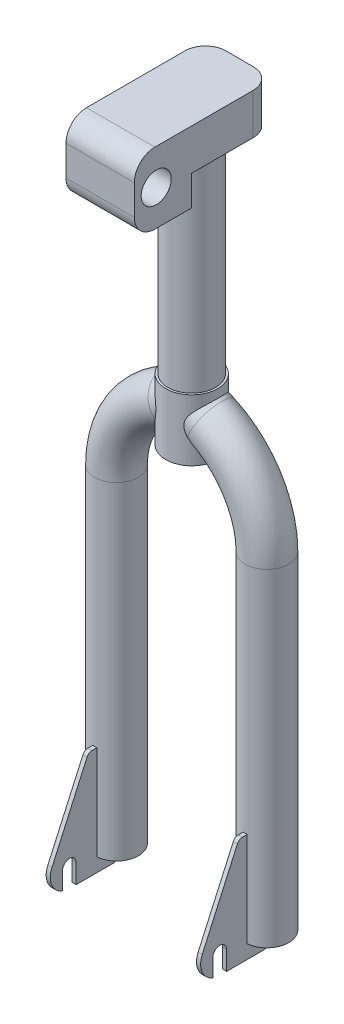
ISO-10303-21;
HEADER;
FILE_DESCRIPTION(('STEP AP214'),'2;1');
FILE_NAME('part.step','',(''),(''),'','','');
FILE_SCHEMA(('AUTOMOTIVE_DESIGN { 1 0 10303 214 1 1 1 1 }'));
ENDSEC;
DATA;
#1=APPLICATION_CONTEXT('core data for automotive mechanical design processes');
#2=APPLICATION_PROTOCOL_DEFINITION('international standard','automotive_design',2000,#1);
#3=PRODUCT_CONTEXT('',#1,'mechanical');
#4=PRODUCT('Part','Part','',(#3));
#5=PRODUCT_RELATED_PRODUCT_CATEGORY('part','',(#4));
#6=PRODUCT_DEFINITION_FORMATION('','',#4);
#7=PRODUCT_DEFINITION_CONTEXT('part definition',#1,'design');
#8=PRODUCT_DEFINITION('design','',#6,#7);
#9=PRODUCT_DEFINITION_SHAPE('','',#8);
#10=(LENGTH_UNIT() NAMED_UNIT(*) SI_UNIT(.MILLI.,.METRE.));
#11=(NAMED_UNIT(*) PLANE_ANGLE_UNIT() SI_UNIT($,.RADIAN.));
#12=(NAMED_UNIT(*) SI_UNIT($,.STERADIAN.) SOLID_ANGLE_UNIT());
#13=UNCERTAINTY_MEASURE_WITH_UNIT(LENGTH_MEASURE(1.E-05),#10,'distance_accuracy_value','');
#14=(GEOMETRIC_REPRESENTATION_CONTEXT(3) GLOBAL_UNCERTAINTY_ASSIGNED_CONTEXT((#13)) GLOBAL_UNIT_ASSIGNED_CONTEXT((#10,
#11,#12)) REPRESENTATION_CONTEXT('',''));
#15=CARTESIAN_POINT('',(0.,0.,0.));
#16=DIRECTION('',(0.,0.,1.));
#17=DIRECTION('',(1.,0.,0.));
#18=AXIS2_PLACEMENT_3D('',#15,#16,#17);
#19=CARTESIAN_POINT('',(0.,152.,0.));
#20=DIRECTION('',(0.,-1.,0.));
#21=DIRECTION('',(0.,0.,-1.));
#22=AXIS2_PLACEMENT_3D('',#19,#20,#21);
#23=CYLINDRICAL_SURFACE('',#22,11.);
#24=CARTESIAN_POINT('',(0.,152.,0.));
#25=DIRECTION('',(0.,1.,0.));
#26=DIRECTION('',(0.,0.,1.));
#27=AXIS2_PLACEMENT_3D('',#24,#25,#26);
#28=CIRCLE('',#27,11.);
#29=CARTESIAN_POINT('',(0.,152.,11.));
#30=VERTEX_POINT('',#29);
#31=EDGE_CURVE('E315',#30,#30,#28,.T.);
#32=ORIENTED_EDGE('',*,*,#31,.T.);
#33=EDGE_LOOP('',(#32));
#34=FACE_BOUND('',#33,.T.);
#35=CARTESIAN_POINT('',(0.,-45.,0.));
#36=DIRECTION('',(0.,-1.,0.));
#37=DIRECTION('',(0.,0.,-1.));
#38=AXIS2_PLACEMENT_3D('',#35,#36,#37);
#39=CIRCLE('',#38,11.);
#40=CARTESIAN_POINT('',(0.,-45.,-11.));
#41=VERTEX_POINT('',#40);
#42=EDGE_CURVE('E450',#41,#41,#39,.T.);
#43=ORIENTED_EDGE('',*,*,#42,.T.);
#44=EDGE_LOOP('',(#43));
#45=FACE_BOUND('',#44,.T.);
#46=ADVANCED_FACE('F32',(#34,#45),#23,.F.);
#47=CARTESIAN_POINT('',(0.,-45.,0.));
#48=DIRECTION('',(0.,1.,0.));
#49=DIRECTION('',(0.,0.,1.));
#50=AXIS2_PLACEMENT_3D('',#47,#48,#49);
#51=CYLINDRICAL_SURFACE('',#50,19.);
#52=CARTESIAN_POINT('',(11.9691600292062,-27.4062891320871,-14.7559888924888));
#53=CARTESIAN_POINT('',(11.8878937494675,-27.1948529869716,-14.8219105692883));
#54=CARTESIAN_POINT('',(11.8079949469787,-26.9821864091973,-14.8856029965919));
#55=CARTESIAN_POINT('',(11.6514603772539,-26.5543138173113,-15.0084424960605));
#56=CARTESIAN_POINT('',(11.5748251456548,-26.3391073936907,-15.0675888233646));
#57=CARTESIAN_POINT('',(11.4251264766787,-25.9054322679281,-15.1814148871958));
#58=CARTESIAN_POINT('',(11.3520756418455,-25.6869551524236,-15.2360792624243));
#59=CARTESIAN_POINT('',(11.2104809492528,-25.2474161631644,-15.3405628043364));
#60=CARTESIAN_POINT('',(11.1419368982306,-25.0263544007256,-15.3903821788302));
#61=CARTESIAN_POINT('',(10.9409211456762,-24.3483923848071,-15.5346003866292));
#62=CARTESIAN_POINT('',(10.8167700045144,-23.8872249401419,-15.6209757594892));
#63=CARTESIAN_POINT('',(10.5983165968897,-22.9544863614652,-15.7700112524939));
#64=CARTESIAN_POINT('',(10.5039738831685,-22.4829302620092,-15.8327035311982));
#65=CARTESIAN_POINT('',(10.3849054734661,-21.7220123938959,-15.9108945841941));
#66=CARTESIAN_POINT('',(10.3474378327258,-21.4355483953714,-15.9352348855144));
#67=CARTESIAN_POINT('',(10.2891196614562,-20.860141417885,-15.9729536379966));
#68=CARTESIAN_POINT('',(10.2682692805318,-20.5711984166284,-15.9863319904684));
#69=CARTESIAN_POINT('',(10.2456504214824,-19.9943023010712,-16.0008388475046));
#70=CARTESIAN_POINT('',(10.2437445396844,-19.7063572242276,-16.0020555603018));
#71=CARTESIAN_POINT('',(10.2606505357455,-19.1312830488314,-15.991221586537));
#72=CARTESIAN_POINT('',(10.2794610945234,-18.8441538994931,-15.9791717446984));
#73=CARTESIAN_POINT('',(10.3394123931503,-18.2695518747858,-15.9404469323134));
#74=CARTESIAN_POINT('',(10.3808282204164,-17.9821192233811,-15.9135917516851));
#75=CARTESIAN_POINT('',(10.4862757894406,-17.4133413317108,-15.8443044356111));
#76=CARTESIAN_POINT('',(10.5503066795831,-17.1319958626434,-15.8018728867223));
#77=CARTESIAN_POINT('',(10.699897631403,-16.5774507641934,-15.7009653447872));
#78=CARTESIAN_POINT('',(10.7854995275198,-16.3042681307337,-15.6424581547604));
#79=CARTESIAN_POINT('',(10.9757834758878,-15.7686415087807,-15.5095331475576));
#80=CARTESIAN_POINT('',(11.080468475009,-15.5061991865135,-15.4351128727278));
#81=CARTESIAN_POINT('',(11.3214014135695,-14.9578978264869,-15.2594564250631));
#82=CARTESIAN_POINT('',(11.4600118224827,-14.6738127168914,-15.15593596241));
#83=CARTESIAN_POINT('',(11.7530697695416,-14.1219251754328,-14.9298221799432));
#84=CARTESIAN_POINT('',(11.9075203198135,-13.8541258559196,-14.807225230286));
#85=CARTESIAN_POINT('',(12.2279942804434,-13.3340873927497,-14.5437020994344));
#86=CARTESIAN_POINT('',(12.394042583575,-13.0818840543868,-14.4027358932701));
#87=CARTESIAN_POINT('',(12.7333622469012,-12.5930557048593,-14.103641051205));
#88=CARTESIAN_POINT('',(12.9066341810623,-12.3564319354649,-13.9455110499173));
#89=CARTESIAN_POINT('',(13.3233231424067,-11.811125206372,-13.5498995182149));
#90=CARTESIAN_POINT('',(13.5684572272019,-11.509083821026,-13.3050437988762));
#91=CARTESIAN_POINT('',(14.0586246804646,-10.9311768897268,-12.7860340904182));
#92=CARTESIAN_POINT('',(14.3036579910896,-10.6553198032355,-12.511870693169));
#93=CARTESIAN_POINT('',(14.7877798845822,-10.1284452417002,-11.9357926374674));
#94=CARTESIAN_POINT('',(15.0268680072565,-9.87742968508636,-11.6338758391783));
#95=CARTESIAN_POINT('',(15.4942040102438,-9.39950717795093,-11.0037954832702));
#96=CARTESIAN_POINT('',(15.7224530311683,-9.17259768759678,-10.6756346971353));
#97=CARTESIAN_POINT('',(16.1668395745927,-8.73979580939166,-9.99011099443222));
#98=CARTESIAN_POINT('',(16.3827810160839,-8.53421507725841,-9.63242384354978));
#99=CARTESIAN_POINT('',(16.7954364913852,-8.14767021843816,-8.89339281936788));
#100=CARTESIAN_POINT('',(16.9921499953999,-7.96670676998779,-8.51204829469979));
#101=CARTESIAN_POINT('',(17.3627874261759,-7.62999643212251,-7.72797248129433));
#102=CARTESIAN_POINT('',(17.5367216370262,-7.47423815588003,-7.32525095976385));
#103=CARTESIAN_POINT('',(17.8587822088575,-7.18857659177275,-6.50075017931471));
#104=CARTESIAN_POINT('',(18.0069095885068,-7.05867228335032,-6.07897167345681));
#105=CARTESIAN_POINT('',(18.2721431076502,-6.82770375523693,-5.22723923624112));
#106=CARTESIAN_POINT('',(18.389773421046,-6.72614953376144,-4.79758181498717));
#107=CARTESIAN_POINT('',(18.5953752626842,-6.54950416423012,-3.92587947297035));
#108=CARTESIAN_POINT('',(18.68334683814,-6.474412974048,-3.48383457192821));
#109=CARTESIAN_POINT('',(18.8279237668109,-6.35136981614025,-2.59107922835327));
#110=CARTESIAN_POINT('',(18.8845405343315,-6.30340797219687,-2.14037200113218));
#111=CARTESIAN_POINT('',(18.9653422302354,-6.23504185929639,-1.23399826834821));
#112=CARTESIAN_POINT('',(18.9895296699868,-6.21463545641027,-0.778332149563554));
#113=CARTESIAN_POINT('',(19.0043433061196,-6.20213328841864,0.0948633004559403));
#114=CARTESIAN_POINT('',(18.9976651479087,-6.20776362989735,0.512318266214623));
#115=CARTESIAN_POINT('',(18.9569222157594,-6.24217473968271,1.34491032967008));
#116=CARTESIAN_POINT('',(18.9228592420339,-6.27095398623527,1.76004757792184));
#117=CARTESIAN_POINT('',(18.8279174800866,-6.35141981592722,2.58493307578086));
#118=CARTESIAN_POINT('',(18.7670421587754,-6.40310343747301,2.99468201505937));
#119=CARTESIAN_POINT('',(18.6194653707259,-6.5289768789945,3.80598374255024));
#120=CARTESIAN_POINT('',(18.532763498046,-6.60316705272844,4.2075364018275));
#121=CARTESIAN_POINT('',(18.3360629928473,-6.7725342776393,4.9951618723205));
#122=CARTESIAN_POINT('',(18.2263480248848,-6.86745632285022,5.38136064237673));
#123=CARTESIAN_POINT('',(17.9846795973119,-7.07820001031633,6.14085609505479));
#124=CARTESIAN_POINT('',(17.8527264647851,-7.19402134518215,6.51415296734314));
#125=CARTESIAN_POINT('',(17.5684658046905,-7.44601455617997,7.24590292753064));
#126=CARTESIAN_POINT('',(17.4161542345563,-7.58219047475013,7.60435304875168));
#127=CARTESIAN_POINT('',(17.0933451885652,-7.87436030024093,8.30458939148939));
#128=CARTESIAN_POINT('',(16.9228470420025,-8.03035493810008,8.64637499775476));
#129=CARTESIAN_POINT('',(16.553357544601,-8.37353644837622,9.33540580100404));
#130=CARTESIAN_POINT('',(16.3532027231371,-8.56215146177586,9.6813163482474));
#131=CARTESIAN_POINT('',(15.9379268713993,-8.96142679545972,10.3507317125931));
#132=CARTESIAN_POINT('',(15.7228044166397,-9.17208921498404,10.6742343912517));
#133=CARTESIAN_POINT('',(15.2810123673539,-9.61569962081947,11.2976418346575));
#134=CARTESIAN_POINT('',(15.0543345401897,-9.84866360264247,11.5975293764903));
#135=CARTESIAN_POINT('',(14.5936599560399,-10.3372478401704,12.1721240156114));
#136=CARTESIAN_POINT('',(14.3596642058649,-10.5928649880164,12.4468345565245));
#137=CARTESIAN_POINT('',(13.9217517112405,-11.0907182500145,12.9335490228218));
#138=CARTESIAN_POINT('',(13.7181575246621,-11.3299044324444,13.1489682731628));
#139=CARTESIAN_POINT('',(13.3127696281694,-11.8268366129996,13.5592510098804));
#140=CARTESIAN_POINT('',(13.1109760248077,-12.0845837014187,13.7541132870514));
#141=CARTESIAN_POINT('',(12.7139968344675,-12.6193384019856,14.121875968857));
#142=CARTESIAN_POINT('',(12.5188016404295,-12.8963160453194,14.2948094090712));
#143=CARTESIAN_POINT('',(12.1401951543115,-13.470946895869,14.6177117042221));
#144=CARTESIAN_POINT('',(11.9567792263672,-13.7685918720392,14.7676896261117));
#145=CARTESIAN_POINT('',(11.6566555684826,-14.29950135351,15.0049393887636));
#146=CARTESIAN_POINT('',(11.5355689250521,-14.5276866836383,15.09805798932));
#147=CARTESIAN_POINT('',(11.3056608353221,-14.9949913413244,15.2709759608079));
#148=CARTESIAN_POINT('',(11.1968356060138,-15.234107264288,15.3507794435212));
#149=CARTESIAN_POINT('',(10.9943524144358,-15.7222054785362,15.4964436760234));
#150=CARTESIAN_POINT('',(10.9006638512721,-15.9711665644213,15.5623326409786));
#151=CARTESIAN_POINT('',(10.7306270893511,-16.4781946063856,15.6800624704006));
#152=CARTESIAN_POINT('',(10.6542784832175,-16.7362613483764,15.7319036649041));
#153=CARTESIAN_POINT('',(10.5204517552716,-17.2607836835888,15.8217141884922));
#154=CARTESIAN_POINT('',(10.4630530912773,-17.527269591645,15.8596251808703));
#155=CARTESIAN_POINT('',(10.3684407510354,-18.065364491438,15.9216407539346));
#156=CARTESIAN_POINT('',(10.3312270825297,-18.3369734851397,15.9457453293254));
#157=CARTESIAN_POINT('',(10.2767581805,-18.8834079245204,15.9809040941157));
#158=CARTESIAN_POINT('',(10.2595334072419,-19.1582376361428,15.9919383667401));
#159=CARTESIAN_POINT('',(10.2440207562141,-19.7086209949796,16.0018777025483));
#160=CARTESIAN_POINT('',(10.2457355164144,-19.9841747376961,16.0007810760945));
#161=CARTESIAN_POINT('',(10.270619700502,-20.6473348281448,15.9848288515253));
#162=CARTESIAN_POINT('',(10.3023094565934,-21.0344929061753,15.9645086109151));
#163=CARTESIAN_POINT('',(10.3941962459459,-21.8039193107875,15.9048285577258));
#164=CARTESIAN_POINT('',(10.4544101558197,-22.1861846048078,15.86545747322));
#165=CARTESIAN_POINT('',(10.5979777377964,-22.945624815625,15.7699177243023));
#166=CARTESIAN_POINT('',(10.6814181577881,-23.3227749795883,15.7136860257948));
#167=CARTESIAN_POINT('',(10.8664263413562,-24.0698356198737,15.5863203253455));
#168=CARTESIAN_POINT('',(10.9679895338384,-24.4397478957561,15.5151900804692));
#169=CARTESIAN_POINT('',(11.2088168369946,-25.2518427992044,15.3423873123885));
#170=CARTESIAN_POINT('',(11.3514814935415,-25.6923164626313,15.2374364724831));
#171=CARTESIAN_POINT('',(11.5762814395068,-26.3432091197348,15.0664692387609));
#172=CARTESIAN_POINT('',(11.6526345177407,-26.557560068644,15.0075291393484));
#173=CARTESIAN_POINT('',(11.8085888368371,-26.9837726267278,14.8851288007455));
#174=CARTESIAN_POINT('',(11.8881900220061,-27.1956342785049,14.821668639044));
#175=CARTESIAN_POINT('',(11.9691600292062,-27.4062891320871,14.7559888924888));
#176=B_SPLINE_CURVE_WITH_KNOTS('',3,(#52,#53,#54,#55,#56,#57,#58,#59,#60,#61,#62,#63,#64,#65,
#66,#67,#68,#69,#70,#71,#72,#73,#74,#75,#76,#77,#78,#79,#80,#81,#82,#83,#84,#85,#86,#87,#88,#89,
#90,#91,#92,#93,#94,#95,#96,#97,#98,#99,#100,#101,#102,#103,#104,#105,#106,#107,#108,#109,#110,
#111,#112,#113,#114,#115,#116,#117,#118,#119,#120,#121,#122,#123,#124,#125,#126,#127,#128,#129,
#130,#131,#132,#133,#134,#135,#136,#137,#138,#139,#140,#141,#142,#143,#144,#145,#146,#147,#148,
#149,#150,#151,#152,#153,#154,#155,#156,#157,#158,#159,#160,#161,#162,#163,#164,#165,#166,#167,
#168,#169,#170,#171,#172,#173,#174,#175),.UNSPECIFIED.,.F.,.F.,(4,2,2,2,2,2,2,2,2,2,2,2,2,2,2,2,
2,2,2,2,2,2,2,2,2,2,2,2,2,2,2,2,2,2,2,2,2,2,2,2,2,2,2,2,2,2,2,2,2,2,2,2,2,2,2,2,2,2,2,2,2,4),
(0.,0.707734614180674,1.41558494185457,2.12576788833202,2.83592036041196,4.29062004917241,
5.7433372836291,6.6125454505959,7.48176144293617,8.34466840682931,9.20752042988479,
10.0811146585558,10.9546759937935,11.8299447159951,12.7053487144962,13.7016920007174,
14.6982251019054,15.6969670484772,16.6957885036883,18.0728198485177,19.4502945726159,
20.8278755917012,22.2053113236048,23.6006581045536,24.9960433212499,26.3907963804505,
27.7854943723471,29.1543370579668,30.5231775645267,31.8915194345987,33.2597553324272,
34.5108687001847,35.7618998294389,37.0127692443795,38.2636583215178,39.4999503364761,
40.736224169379,41.9727438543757,43.209309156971,44.5336516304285,45.8581203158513,
47.1835461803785,48.5087904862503,49.6504909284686,50.7922584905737,51.9322850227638,
53.0718600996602,53.8949293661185,54.7177439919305,55.5388737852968,56.3599842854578,
57.1844952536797,58.0090065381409,58.8347726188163,59.6606537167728,60.8256474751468,
61.9913313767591,63.1614287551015,64.3312314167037,65.7545207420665,66.4596201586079,
67.1647074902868),.UNSPECIFIED.);
#177=CARTESIAN_POINT('',(11.9691600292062,-27.4062891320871,-14.7559888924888));
#178=VERTEX_POINT('',#177);
#179=CARTESIAN_POINT('',(11.9691600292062,-27.4062891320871,14.7559888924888));
#180=VERTEX_POINT('',#179);
#181=EDGE_CURVE('E476',#178,#180,#176,.T.);
#182=ORIENTED_EDGE('',*,*,#181,.F.);
#183=CARTESIAN_POINT('',(17.8099038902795,-7.2991697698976,6.61871010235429));
#184=CARTESIAN_POINT('',(17.7321324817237,-7.36960263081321,6.82798737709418));
#185=CARTESIAN_POINT('',(17.6510500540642,-7.44339859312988,7.0348618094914));
#186=CARTESIAN_POINT('',(17.4826462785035,-7.59762871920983,7.44351455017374));
#187=CARTESIAN_POINT('',(17.3953254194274,-7.67806236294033,7.64529325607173));
#188=CARTESIAN_POINT('',(17.124692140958,-7.92908325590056,8.2423088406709));
#189=CARTESIAN_POINT('',(16.9325946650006,-8.10949327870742,8.62953073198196));
#190=CARTESIAN_POINT('',(16.5283990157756,-8.49589347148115,9.38051930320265));
#191=CARTESIAN_POINT('',(16.3162807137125,-8.70190945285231,9.74426174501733));
#192=CARTESIAN_POINT('',(15.8760429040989,-9.13895907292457,10.4461889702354));
#193=CARTESIAN_POINT('',(15.6479218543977,-9.36999512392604,10.7843712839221));
#194=CARTESIAN_POINT('',(15.1803259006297,-9.85660167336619,11.4331699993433));
#195=CARTESIAN_POINT('',(14.9408675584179,-10.1121369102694,11.7438248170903));
#196=CARTESIAN_POINT('',(14.4550749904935,-10.6484097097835,12.3368429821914));
#197=CARTESIAN_POINT('',(14.2087398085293,-10.9291507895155,12.6192023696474));
#198=CARTESIAN_POINT('',(13.7150702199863,-11.5164488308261,13.1540557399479));
#199=CARTESIAN_POINT('',(13.4677367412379,-11.8229855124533,13.4065728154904));
#200=CARTESIAN_POINT('',(12.9787969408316,-12.4634232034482,13.8804361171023));
#201=CARTESIAN_POINT('',(12.7371879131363,-12.7973109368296,14.101797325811));
#202=CARTESIAN_POINT('',(12.351561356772,-13.3705610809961,14.4388171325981));
#203=CARTESIAN_POINT('',(12.2033216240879,-13.6014519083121,14.5641211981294));
#204=CARTESIAN_POINT('',(11.9157293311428,-14.0757536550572,14.8003365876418));
#205=CARTESIAN_POINT('',(11.7763740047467,-14.3191606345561,14.9112524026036));
#206=CARTESIAN_POINT('',(11.5100410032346,-14.8182288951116,15.1177814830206));
#207=CARTESIAN_POINT('',(11.3830384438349,-15.0738639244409,15.2134257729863));
#208=CARTESIAN_POINT('',(11.1446508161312,-15.5976171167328,15.3889142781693));
#209=CARTESIAN_POINT('',(11.0332658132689,-15.8657353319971,15.4687584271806));
#210=CARTESIAN_POINT('',(10.8283407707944,-16.417255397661,15.6129107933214));
#211=CARTESIAN_POINT('',(10.7350651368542,-16.7008159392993,15.6769920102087));
#212=CARTESIAN_POINT('',(10.5715815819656,-17.2778300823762,15.7876994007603));
#213=CARTESIAN_POINT('',(10.5013705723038,-17.5712823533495,15.8343279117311));
#214=CARTESIAN_POINT('',(10.3861695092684,-18.1651190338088,15.9101309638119));
#215=CARTESIAN_POINT('',(10.3411636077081,-18.4654989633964,15.939316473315));
#216=CARTESIAN_POINT('',(10.2767627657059,-19.0701280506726,15.9809139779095));
#217=CARTESIAN_POINT('',(10.2573708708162,-19.3743776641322,15.9933239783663));
#218=CARTESIAN_POINT('',(10.2424315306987,-20.006814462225,16.002896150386));
#219=CARTESIAN_POINT('',(10.248810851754,-20.3350614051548,15.9988261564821));
#220=CARTESIAN_POINT('',(10.2866836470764,-20.9894364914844,15.9744981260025));
#221=CARTESIAN_POINT('',(10.3181823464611,-21.3155641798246,15.9542367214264));
#222=CARTESIAN_POINT('',(10.4025338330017,-21.9648625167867,15.8993646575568));
#223=CARTESIAN_POINT('',(10.4554592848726,-22.2880192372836,15.864705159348));
#224=CARTESIAN_POINT('',(10.5787196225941,-22.9292924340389,15.782780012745));
#225=CARTESIAN_POINT('',(10.6490547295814,-23.2474088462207,15.7355142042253));
#226=CARTESIAN_POINT('',(10.8045298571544,-23.8821252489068,15.6291746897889));
#227=CARTESIAN_POINT('',(10.8898385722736,-24.1986604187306,15.5699651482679));
#228=CARTESIAN_POINT('',(11.0715911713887,-24.8264392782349,15.4412522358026));
#229=CARTESIAN_POINT('',(11.1680378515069,-25.1376816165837,15.3717462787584));
#230=CARTESIAN_POINT('',(11.3696116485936,-25.7553641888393,15.2232591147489));
#231=CARTESIAN_POINT('',(11.4747468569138,-26.0617996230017,15.1442690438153));
#232=CARTESIAN_POINT('',(11.6915593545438,-26.6698839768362,14.9775213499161));
#233=CARTESIAN_POINT('',(11.8032361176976,-26.9715332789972,14.8897644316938));
#234=CARTESIAN_POINT('',(12.0318629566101,-27.5713892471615,14.7056415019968));
#235=CARTESIAN_POINT('',(12.1488291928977,-27.8695812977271,14.6092480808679));
#236=CARTESIAN_POINT('',(12.3863414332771,-28.461800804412,14.4084258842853));
#237=CARTESIAN_POINT('',(12.5068874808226,-28.7558282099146,14.3039970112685));
#238=CARTESIAN_POINT('',(12.7503898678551,-29.3397902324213,14.0873738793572));
#239=CARTESIAN_POINT('',(12.8733448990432,-29.629726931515,13.9751837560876));
#240=CARTESIAN_POINT('',(13.1208172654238,-30.2058296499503,13.7431050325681));
#241=CARTESIAN_POINT('',(13.2453346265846,-30.4919956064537,13.6232163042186));
#242=CARTESIAN_POINT('',(13.5212557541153,-31.120040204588,13.3499367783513));
#243=CARTESIAN_POINT('',(13.6728429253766,-31.4610708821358,13.1947788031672));
#244=CARTESIAN_POINT('',(13.9760359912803,-32.1377819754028,12.873199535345));
#245=CARTESIAN_POINT('',(14.1276418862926,-32.4734622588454,12.7067779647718));
#246=CARTESIAN_POINT('',(14.4299783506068,-33.1395025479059,12.3623729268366));
#247=CARTESIAN_POINT('',(14.5807084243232,-33.4698596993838,12.1843834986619));
#248=CARTESIAN_POINT('',(14.8803497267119,-34.1247615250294,11.8165759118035));
#249=CARTESIAN_POINT('',(15.0292609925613,-34.449306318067,11.6267579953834));
#250=CARTESIAN_POINT('',(15.3238004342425,-35.090626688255,11.2356929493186));
#251=CARTESIAN_POINT('',(15.4694404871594,-35.4074309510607,11.0345019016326));
#252=CARTESIAN_POINT('',(15.7573849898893,-36.0341020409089,10.6192592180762));
#253=CARTESIAN_POINT('',(15.8996892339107,-36.3439684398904,10.4052067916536));
#254=CARTESIAN_POINT('',(16.1800622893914,-36.955508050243,9.96363073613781));
#255=CARTESIAN_POINT('',(16.3181344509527,-37.2571877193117,9.73611820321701));
#256=CARTESIAN_POINT('',(16.5893072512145,-37.8512398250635,9.26652057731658));
#257=CARTESIAN_POINT('',(16.7224088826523,-38.1436141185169,9.02443841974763));
#258=CARTESIAN_POINT('',(16.955603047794,-38.6575672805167,8.57655492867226));
#259=CARTESIAN_POINT('',(17.0567975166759,-38.8812099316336,8.37369631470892));
#260=CARTESIAN_POINT('',(17.2549332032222,-39.320408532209,7.95741310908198));
#261=CARTESIAN_POINT('',(17.3518746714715,-39.5359649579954,7.74398914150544));
#262=CARTESIAN_POINT('',(17.5409980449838,-39.9578604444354,7.30551030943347));
#263=CARTESIAN_POINT('',(17.6331728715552,-40.1641857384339,7.08043908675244));
#264=CARTESIAN_POINT('',(17.8118321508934,-40.5654574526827,6.61816007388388));
#265=CARTESIAN_POINT('',(17.8983165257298,-40.7604037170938,6.38095211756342));
#266=CARTESIAN_POINT('',(18.0655398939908,-41.1386385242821,5.89100938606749));
#267=CARTESIAN_POINT('',(18.1462069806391,-41.32177890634,5.63813490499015));
#268=CARTESIAN_POINT('',(18.2995706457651,-41.6711376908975,5.11850458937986));
#269=CARTESIAN_POINT('',(18.3722661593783,-41.8373538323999,4.85174690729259));
#270=CARTESIAN_POINT('',(18.5080739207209,-42.1488457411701,4.30469978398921));
#271=CARTESIAN_POINT('',(18.5712078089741,-42.2941687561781,4.02444285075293));
#272=CARTESIAN_POINT('',(18.6863977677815,-42.5600357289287,3.45023619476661));
#273=CARTESIAN_POINT('',(18.7384599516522,-42.6805933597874,3.15629413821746));
#274=CARTESIAN_POINT('',(18.8154414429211,-42.859236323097,2.65003658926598));
#275=CARTESIAN_POINT('',(18.8437567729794,-42.9250664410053,2.44095447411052));
#276=CARTESIAN_POINT('',(18.8937487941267,-43.0414312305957,2.01782042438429));
#277=CARTESIAN_POINT('',(18.915427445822,-43.0919704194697,1.80376997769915));
#278=CARTESIAN_POINT('',(18.9516351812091,-43.1764498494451,1.37200836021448));
#279=CARTESIAN_POINT('',(18.9661708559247,-43.2104053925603,1.15430075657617));
#280=CARTESIAN_POINT('',(18.9877508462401,-43.2608366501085,0.716481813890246));
#281=CARTESIAN_POINT('',(18.9947950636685,-43.2773121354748,0.496370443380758));
#282=CARTESIAN_POINT('',(19.0012079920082,-43.2923105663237,0.0547667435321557));
#283=CARTESIAN_POINT('',(19.0005539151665,-43.2907802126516,-0.166727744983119));
#284=CARTESIAN_POINT('',(18.9915338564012,-43.2696858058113,-0.608686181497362));
#285=CARTESIAN_POINT('',(18.983168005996,-43.250122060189,-0.829150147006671));
#286=CARTESIAN_POINT('',(18.9589429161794,-43.1935218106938,-1.26756604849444));
#287=CARTESIAN_POINT('',(18.943077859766,-43.1564717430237,-1.48551589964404));
#288=CARTESIAN_POINT('',(18.9042565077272,-43.0659270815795,-1.91731840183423));
#289=CARTESIAN_POINT('',(18.8812993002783,-43.012430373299,-2.13117052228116));
#290=CARTESIAN_POINT('',(18.8220111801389,-42.8744961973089,-2.60838645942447));
#291=CARTESIAN_POINT('',(18.7837566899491,-42.7856341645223,-2.87023744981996));
#292=CARTESIAN_POINT('',(18.6979966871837,-42.5869220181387,-3.38421407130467));
#293=CARTESIAN_POINT('',(18.6504885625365,-42.4770659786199,-3.63633693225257));
#294=CARTESIAN_POINT('',(18.4956837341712,-42.1201360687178,-4.37776119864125));
#295=CARTESIAN_POINT('',(18.3761791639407,-41.8458703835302,-4.85156844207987));
#296=CARTESIAN_POINT('',(18.1357905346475,-41.297898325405,-5.67850965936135));
#297=CARTESIAN_POINT('',(18.0187101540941,-41.0322780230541,-6.03835127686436));
#298=CARTESIAN_POINT('',(17.7712682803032,-40.4739521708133,-6.73182662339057));
#299=CARTESIAN_POINT('',(17.6408974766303,-40.1812276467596,-7.06544168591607));
#300=CARTESIAN_POINT('',(17.3692327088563,-39.5743558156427,-7.70922532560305));
#301=CARTESIAN_POINT('',(17.2279131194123,-39.2601584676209,-8.01933531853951));
#302=CARTESIAN_POINT('',(16.9365483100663,-38.615257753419,-8.61765885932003));
#303=CARTESIAN_POINT('',(16.7864999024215,-38.2845483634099,-8.90586431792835));
#304=CARTESIAN_POINT('',(16.484421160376,-37.62113248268,-9.45294624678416));
#305=CARTESIAN_POINT('',(16.3326231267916,-37.2888590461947,-9.71247971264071));
#306=CARTESIAN_POINT('',(16.023615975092,-36.6140392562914,-10.2142307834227));
#307=CARTESIAN_POINT('',(15.8664076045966,-36.271494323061,-10.4564507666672));
#308=CARTESIAN_POINT('',(15.5474879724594,-35.5772218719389,-10.9250170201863));
#309=CARTESIAN_POINT('',(15.3857724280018,-35.2254856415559,-11.1513474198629));
#310=CARTESIAN_POINT('',(15.0590306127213,-34.5141833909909,-11.588792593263));
#311=CARTESIAN_POINT('',(14.894004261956,-34.154617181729,-11.7999069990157));
#312=CARTESIAN_POINT('',(14.5617947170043,-33.4285092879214,-12.2075065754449));
#313=CARTESIAN_POINT('',(14.3946124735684,-33.0619706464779,-12.403997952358));
#314=CARTESIAN_POINT('',(14.0591977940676,-32.3221658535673,-12.7829169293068));
#315=CARTESIAN_POINT('',(13.890965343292,-31.9488996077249,-12.9653443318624));
#316=CARTESIAN_POINT('',(13.5549166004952,-31.1960342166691,-13.3162759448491));
#317=CARTESIAN_POINT('',(13.3871001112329,-30.8164392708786,-13.4847889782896));
#318=CARTESIAN_POINT('',(13.0534152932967,-30.0506270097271,-13.8080515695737));
#319=CARTESIAN_POINT('',(12.8875468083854,-29.6644102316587,-13.9628022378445));
#320=CARTESIAN_POINT('',(12.5645169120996,-28.8962889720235,-14.254080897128));
#321=CARTESIAN_POINT('',(12.4072424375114,-28.5145831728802,-14.3910066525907));
#322=CARTESIAN_POINT('',(12.0988031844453,-27.7441114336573,-14.6512681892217));
#323=CARTESIAN_POINT('',(11.9476383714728,-27.3553455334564,-14.7746040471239));
#324=CARTESIAN_POINT('',(11.6544353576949,-26.569904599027,-15.0069693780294));
#325=CARTESIAN_POINT('',(11.5124015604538,-26.1732258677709,-15.1159919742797));
#326=CARTESIAN_POINT('',(11.2416229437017,-25.3713946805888,-15.3184353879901));
#327=CARTESIAN_POINT('',(11.1128768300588,-24.9662430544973,-15.4118577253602));
#328=CARTESIAN_POINT('',(10.8922497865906,-24.2090964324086,-15.568376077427));
#329=CARTESIAN_POINT('',(10.7977399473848,-23.8583837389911,-15.6339233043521));
#330=CARTESIAN_POINT('',(10.6263906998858,-23.1501913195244,-15.7508919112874));
#331=CARTESIAN_POINT('',(10.5495535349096,-22.7927107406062,-15.8023114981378));
#332=CARTESIAN_POINT('',(10.4188464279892,-22.0726906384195,-15.8887945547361));
#333=CARTESIAN_POINT('',(10.3649042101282,-21.710170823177,-15.9239095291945));
#334=CARTESIAN_POINT('',(10.2852696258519,-20.9807117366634,-15.97546852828));
#335=CARTESIAN_POINT('',(10.2595603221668,-20.6137752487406,-15.9919237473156));
#336=CARTESIAN_POINT('',(10.2441402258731,-19.9843970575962,-16.001799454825));
#337=CARTESIAN_POINT('',(10.2462068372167,-19.7222329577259,-16.0004810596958));
#338=CARTESIAN_POINT('',(10.268651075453,-19.1989949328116,-15.9860880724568));
#339=CARTESIAN_POINT('',(10.2890261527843,-18.9379208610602,-15.9730151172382));
#340=CARTESIAN_POINT('',(10.3486818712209,-18.4190562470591,-15.9344292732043));
#341=CARTESIAN_POINT('',(10.3879481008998,-18.161263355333,-15.9089258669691));
#342=CARTESIAN_POINT('',(10.4850546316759,-17.650805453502,-15.8450936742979));
#343=CARTESIAN_POINT('',(10.5428956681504,-17.3981406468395,-15.8067643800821));
#344=CARTESIAN_POINT('',(10.6757349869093,-16.9004425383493,-15.7173488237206));
#345=CARTESIAN_POINT('',(10.7506869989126,-16.6553906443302,-15.6662969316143));
#346=CARTESIAN_POINT('',(10.9159197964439,-16.1735725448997,-15.5516169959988));
#347=CARTESIAN_POINT('',(11.00620082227,-15.9368064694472,-15.4879887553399));
#348=CARTESIAN_POINT('',(11.199976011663,-15.471991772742,-15.348446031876));
#349=CARTESIAN_POINT('',(11.303493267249,-15.2439593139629,-15.2725100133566));
#350=CARTESIAN_POINT('',(11.5212511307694,-14.7973896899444,-15.1089159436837));
#351=CARTESIAN_POINT('',(11.6354949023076,-14.5788553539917,-15.0212544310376));
#352=CARTESIAN_POINT('',(11.9341124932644,-14.0400143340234,-14.7861217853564));
#353=CARTESIAN_POINT('',(12.1240257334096,-13.7259722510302,-14.6312769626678));
#354=CARTESIAN_POINT('',(12.5162502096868,-13.1193008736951,-14.2972003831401));
#355=CARTESIAN_POINT('',(12.7185676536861,-12.8266824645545,-14.1179563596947));
#356=CARTESIAN_POINT('',(13.1300851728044,-12.2613847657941,-13.7360765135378));
#357=CARTESIAN_POINT('',(13.339296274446,-11.9887399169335,-13.53340177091));
#358=CARTESIAN_POINT('',(13.7594787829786,-11.462969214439,-13.1059749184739));
#359=CARTESIAN_POINT('',(13.9704499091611,-11.2098403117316,-12.8812262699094));
#360=CARTESIAN_POINT('',(14.3985227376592,-10.7126664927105,-12.4012092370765));
#361=CARTESIAN_POINT('',(14.6155386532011,-10.4693719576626,-12.1450874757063));
#362=CARTESIAN_POINT('',(15.0435112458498,-10.0024299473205,-11.6107698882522));
#363=CARTESIAN_POINT('',(15.2544672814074,-9.77878454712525,-11.3325717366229));
#364=CARTESIAN_POINT('',(15.666620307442,-9.35136558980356,-10.7555776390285));
#365=CARTESIAN_POINT('',(15.8678349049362,-9.14755545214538,-10.4568214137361));
#366=CARTESIAN_POINT('',(16.2579122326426,-8.75947812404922,-9.83939426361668));
#367=CARTESIAN_POINT('',(16.4467780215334,-8.57520608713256,-9.52072830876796));
#368=CARTESIAN_POINT('',(16.8506486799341,-8.18688240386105,-8.79015626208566));
#369=CARTESIAN_POINT('',(17.0618891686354,-7.98779957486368,-8.37347581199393));
#370=CARTESIAN_POINT('',(17.3583649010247,-7.71218479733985,-7.72937112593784));
#371=CARTESIAN_POINT('',(17.4538120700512,-7.62413067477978,-7.5114370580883));
#372=CARTESIAN_POINT('',(17.6374374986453,-7.45579077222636,-7.06951639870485));
#373=CARTESIAN_POINT('',(17.72561388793,-7.37550699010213,-6.84552826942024));
#374=CARTESIAN_POINT('',(17.8099038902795,-7.29916976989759,-6.6187101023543));
#375=B_SPLINE_CURVE_WITH_KNOTS('',3,(#183,#184,#185,#186,#187,#188,#189,#190,#191,#192,#193,
#194,#195,#196,#197,#198,#199,#200,#201,#202,#203,#204,#205,#206,#207,#208,#209,#210,#211,#212,
#213,#214,#215,#216,#217,#218,#219,#220,#221,#222,#223,#224,#225,#226,#227,#228,#229,#230,#231,
#232,#233,#234,#235,#236,#237,#238,#239,#240,#241,#242,#243,#244,#245,#246,#247,#248,#249,#250,
#251,#252,#253,#254,#255,#256,#257,#258,#259,#260,#261,#262,#263,#264,#265,#266,#267,#268,#269,
#270,#271,#272,#273,#274,#275,#276,#277,#278,#279,#280,#281,#282,#283,#284,#285,#286,#287,#288,
#289,#290,#291,#292,#293,#294,#295,#296,#297,#298,#299,#300,#301,#302,#303,#304,#305,#306,#307,
#308,#309,#310,#311,#312,#313,#314,#315,#316,#317,#318,#319,#320,#321,#322,#323,#324,#325,#326,
#327,#328,#329,#330,#331,#332,#333,#334,#335,#336,#337,#338,#339,#340,#341,#342,#343,#344,#345,
#346,#347,#348,#349,#350,#351,#352,#353,#354,#355,#356,#357,#358,#359,#360,#361,#362,#363,#364,
#365,#366,#367,#368,#369,#370,#371,#372,#373,#374),.UNSPECIFIED.,.F.,.F.,(4,2,2,2,2,2,2,2,2,2,2,
2,2,2,2,2,2,2,2,2,2,2,2,2,2,2,2,2,2,2,2,2,2,2,2,2,2,2,2,2,2,2,2,2,2,2,2,2,2,2,2,2,2,2,2,2,2,2,2,
2,2,2,2,2,2,2,2,2,2,2,2,2,2,2,2,2,2,2,2,2,2,2,2,2,2,2,2,2,2,2,2,2,2,2,2,4),(0.,
0.702193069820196,1.40433117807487,2.80758485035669,4.21226468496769,5.61708007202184,
7.01990303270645,8.422922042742,9.82484815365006,11.2260977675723,12.1303969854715,
13.03441326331,13.9365689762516,14.838728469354,15.7532053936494,16.6675598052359,
17.5813386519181,18.4952261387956,19.4786570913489,20.4622926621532,21.4492923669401,
22.4363046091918,23.4352486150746,24.4344439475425,25.4345805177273,26.4346367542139,
27.4379876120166,28.4413506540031,29.4441831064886,30.4470322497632,31.6593496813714,
32.8716970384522,34.0846741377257,35.2976264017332,36.5050459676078,37.7125398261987,
38.919051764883,40.1253214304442,41.0803935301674,42.0354092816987,42.9918047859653,
43.9482133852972,44.9149221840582,45.8817599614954,46.8463757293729,47.81045748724,
48.4729203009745,49.1351872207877,49.7968418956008,50.4585052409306,51.1221276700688,
51.7857387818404,52.4498654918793,53.1140776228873,53.9502224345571,54.7866036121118,
56.4610845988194,57.8463363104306,59.2325651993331,60.6221426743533,62.0122308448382,
63.3560388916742,64.6996619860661,66.0446085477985,67.3895876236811,68.733992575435,
70.07841640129,71.4219810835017,72.7654372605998,74.0700127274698,75.3745808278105,
76.6797734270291,77.9848387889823,79.0915064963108,80.1983146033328,81.3016022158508,
82.4042275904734,83.1899490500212,83.9755611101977,84.7605748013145,85.5456195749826,
86.3285661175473,87.1115249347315,87.8958688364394,88.680444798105,89.8735904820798,
91.0673382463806,92.2630981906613,93.4586709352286,94.7013296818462,95.94411950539,
97.1845721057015,98.4247162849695,99.9456621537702,100.706481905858,101.467496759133),.UNSPECIFIED.);
#376=EDGE_CURVE('E465',#180,#178,#375,.T.);
#377=ORIENTED_EDGE('',*,*,#376,.F.);
#378=EDGE_LOOP('',(#182,#377));
#379=FACE_BOUND('',#378,.T.);
#380=CARTESIAN_POINT('',(0.,-45.,0.));
#381=DIRECTION('',(0.,-1.,0.));
#382=DIRECTION('',(0.,0.,-1.));
#383=AXIS2_PLACEMENT_3D('',#380,#381,#382);
#384=CIRCLE('',#383,19.);
#385=CARTESIAN_POINT('',(0.,-45.,-19.));
#386=VERTEX_POINT('',#385);
#387=EDGE_CURVE('E454',#386,#386,#384,.T.);
#388=ORIENTED_EDGE('',*,*,#387,.F.);
#389=EDGE_LOOP('',(#388));
#390=FACE_BOUND('',#389,.T.);
#391=CARTESIAN_POINT('',(0.,0.,0.));
#392=DIRECTION('',(0.,-1.,0.));
#393=DIRECTION('',(0.,0.,-1.));
#394=AXIS2_PLACEMENT_3D('',#391,#392,#393);
#395=CIRCLE('',#394,19.);
#396=CARTESIAN_POINT('',(0.,0.,-19.));
#397=VERTEX_POINT('',#396);
#398=EDGE_CURVE('E453',#397,#397,#395,.T.);
#399=ORIENTED_EDGE('',*,*,#398,.T.);
#400=EDGE_LOOP('',(#399));
#401=FACE_BOUND('',#400,.T.);
#402=CARTESIAN_POINT('',(-11.9691600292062,-27.4062891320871,14.7559888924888));
#403=CARTESIAN_POINT('',(-11.8878937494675,-27.1948529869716,14.8219105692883));
#404=CARTESIAN_POINT('',(-11.8079949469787,-26.9821864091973,14.8856029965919));
#405=CARTESIAN_POINT('',(-11.6514603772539,-26.5543138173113,15.0084424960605));
#406=CARTESIAN_POINT('',(-11.5748251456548,-26.3391073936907,15.0675888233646));
#407=CARTESIAN_POINT('',(-11.4251264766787,-25.9054322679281,15.1814148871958));
#408=CARTESIAN_POINT('',(-11.3520756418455,-25.6869551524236,15.2360792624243));
#409=CARTESIAN_POINT('',(-11.2104809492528,-25.2474161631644,15.3405628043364));
#410=CARTESIAN_POINT('',(-11.1419368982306,-25.0263544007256,15.3903821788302));
#411=CARTESIAN_POINT('',(-10.9409211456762,-24.3483923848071,15.5346003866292));
#412=CARTESIAN_POINT('',(-10.8167700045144,-23.8872249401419,15.6209757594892));
#413=CARTESIAN_POINT('',(-10.5983165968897,-22.9544863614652,15.7700112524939));
#414=CARTESIAN_POINT('',(-10.5039738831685,-22.4829302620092,15.8327035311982));
#415=CARTESIAN_POINT('',(-10.3849054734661,-21.7220123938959,15.9108945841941));
#416=CARTESIAN_POINT('',(-10.3474378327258,-21.4355483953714,15.9352348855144));
#417=CARTESIAN_POINT('',(-10.2891196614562,-20.860141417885,15.9729536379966));
#418=CARTESIAN_POINT('',(-10.2682692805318,-20.5711984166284,15.9863319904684));
#419=CARTESIAN_POINT('',(-10.2456504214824,-19.9943023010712,16.0008388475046));
#420=CARTESIAN_POINT('',(-10.2437445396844,-19.7063572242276,16.0020555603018));
#421=CARTESIAN_POINT('',(-10.2606505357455,-19.1312830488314,15.991221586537));
#422=CARTESIAN_POINT('',(-10.2794610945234,-18.8441538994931,15.9791717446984));
#423=CARTESIAN_POINT('',(-10.3394123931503,-18.2695518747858,15.9404469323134));
#424=CARTESIAN_POINT('',(-10.3808282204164,-17.9821192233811,15.9135917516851));
#425=CARTESIAN_POINT('',(-10.4862757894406,-17.4133413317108,15.8443044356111));
#426=CARTESIAN_POINT('',(-10.5503066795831,-17.1319958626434,15.8018728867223));
#427=CARTESIAN_POINT('',(-10.699897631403,-16.5774507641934,15.7009653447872));
#428=CARTESIAN_POINT('',(-10.7854995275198,-16.3042681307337,15.6424581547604));
#429=CARTESIAN_POINT('',(-10.9757834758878,-15.7686415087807,15.5095331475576));
#430=CARTESIAN_POINT('',(-11.080468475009,-15.5061991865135,15.4351128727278));
#431=CARTESIAN_POINT('',(-11.3214014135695,-14.9578978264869,15.2594564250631));
#432=CARTESIAN_POINT('',(-11.4600118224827,-14.6738127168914,15.15593596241));
#433=CARTESIAN_POINT('',(-11.7530697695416,-14.1219251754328,14.9298221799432));
#434=CARTESIAN_POINT('',(-11.9075203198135,-13.8541258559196,14.807225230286));
#435=CARTESIAN_POINT('',(-12.2279942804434,-13.3340873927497,14.5437020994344));
#436=CARTESIAN_POINT('',(-12.394042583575,-13.0818840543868,14.4027358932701));
#437=CARTESIAN_POINT('',(-12.7333622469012,-12.5930557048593,14.103641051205));
#438=CARTESIAN_POINT('',(-12.9066341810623,-12.3564319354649,13.9455110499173));
#439=CARTESIAN_POINT('',(-13.3233231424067,-11.811125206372,13.5498995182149));
#440=CARTESIAN_POINT('',(-13.5684572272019,-11.509083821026,13.3050437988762));
#441=CARTESIAN_POINT('',(-14.0586246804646,-10.9311768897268,12.7860340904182));
#442=CARTESIAN_POINT('',(-14.3036579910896,-10.6553198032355,12.511870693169));
#443=CARTESIAN_POINT('',(-14.7877798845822,-10.1284452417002,11.9357926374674));
#444=CARTESIAN_POINT('',(-15.0268680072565,-9.87742968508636,11.6338758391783));
#445=CARTESIAN_POINT('',(-15.4942040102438,-9.39950717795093,11.0037954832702));
#446=CARTESIAN_POINT('',(-15.7224530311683,-9.17259768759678,10.6756346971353));
#447=CARTESIAN_POINT('',(-16.1668395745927,-8.73979580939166,9.99011099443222));
#448=CARTESIAN_POINT('',(-16.3827810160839,-8.53421507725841,9.63242384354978));
#449=CARTESIAN_POINT('',(-16.7954364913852,-8.14767021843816,8.89339281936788));
#450=CARTESIAN_POINT('',(-16.9921499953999,-7.96670676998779,8.51204829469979));
#451=CARTESIAN_POINT('',(-17.3627874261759,-7.62999643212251,7.72797248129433));
#452=CARTESIAN_POINT('',(-17.5367216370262,-7.47423815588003,7.32525095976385));
#453=CARTESIAN_POINT('',(-17.8587822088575,-7.18857659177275,6.50075017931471));
#454=CARTESIAN_POINT('',(-18.0069095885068,-7.05867228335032,6.07897167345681));
#455=CARTESIAN_POINT('',(-18.2721431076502,-6.82770375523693,5.22723923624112));
#456=CARTESIAN_POINT('',(-18.389773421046,-6.72614953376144,4.79758181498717));
#457=CARTESIAN_POINT('',(-18.5953752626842,-6.54950416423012,3.92587947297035));
#458=CARTESIAN_POINT('',(-18.68334683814,-6.474412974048,3.48383457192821));
#459=CARTESIAN_POINT('',(-18.8279237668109,-6.35136981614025,2.59107922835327));
#460=CARTESIAN_POINT('',(-18.8845405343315,-6.30340797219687,2.14037200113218));
#461=CARTESIAN_POINT('',(-18.9653422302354,-6.23504185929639,1.23399826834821));
#462=CARTESIAN_POINT('',(-18.9895296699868,-6.21463545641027,0.778332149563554));
#463=CARTESIAN_POINT('',(-19.0043433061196,-6.20213328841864,-0.0948633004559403));
#464=CARTESIAN_POINT('',(-18.9976651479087,-6.20776362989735,-0.512318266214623));
#465=CARTESIAN_POINT('',(-18.9569222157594,-6.24217473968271,-1.34491032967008));
#466=CARTESIAN_POINT('',(-18.9228592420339,-6.27095398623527,-1.76004757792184));
#467=CARTESIAN_POINT('',(-18.8279174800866,-6.35141981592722,-2.58493307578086));
#468=CARTESIAN_POINT('',(-18.7670421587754,-6.40310343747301,-2.99468201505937));
#469=CARTESIAN_POINT('',(-18.6194653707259,-6.5289768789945,-3.80598374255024));
#470=CARTESIAN_POINT('',(-18.532763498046,-6.60316705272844,-4.2075364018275));
#471=CARTESIAN_POINT('',(-18.3360629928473,-6.7725342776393,-4.9951618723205));
#472=CARTESIAN_POINT('',(-18.2263480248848,-6.86745632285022,-5.38136064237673));
#473=CARTESIAN_POINT('',(-17.9846795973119,-7.07820001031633,-6.14085609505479));
#474=CARTESIAN_POINT('',(-17.8527264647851,-7.19402134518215,-6.51415296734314));
#475=CARTESIAN_POINT('',(-17.5684658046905,-7.44601455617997,-7.24590292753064));
#476=CARTESIAN_POINT('',(-17.4161542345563,-7.58219047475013,-7.60435304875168));
#477=CARTESIAN_POINT('',(-17.0933451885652,-7.87436030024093,-8.30458939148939));
#478=CARTESIAN_POINT('',(-16.9228470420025,-8.03035493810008,-8.64637499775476));
#479=CARTESIAN_POINT('',(-16.553357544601,-8.37353644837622,-9.33540580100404));
#480=CARTESIAN_POINT('',(-16.3532027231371,-8.56215146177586,-9.6813163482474));
#481=CARTESIAN_POINT('',(-15.9379268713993,-8.96142679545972,-10.3507317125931));
#482=CARTESIAN_POINT('',(-15.7228044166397,-9.17208921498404,-10.6742343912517));
#483=CARTESIAN_POINT('',(-15.2810123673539,-9.61569962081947,-11.2976418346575));
#484=CARTESIAN_POINT('',(-15.0543345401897,-9.84866360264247,-11.5975293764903));
#485=CARTESIAN_POINT('',(-14.5936599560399,-10.3372478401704,-12.1721240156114));
#486=CARTESIAN_POINT('',(-14.3596642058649,-10.5928649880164,-12.4468345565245));
#487=CARTESIAN_POINT('',(-13.9217517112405,-11.0907182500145,-12.9335490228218));
#488=CARTESIAN_POINT('',(-13.7181575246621,-11.3299044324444,-13.1489682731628));
#489=CARTESIAN_POINT('',(-13.3127696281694,-11.8268366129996,-13.5592510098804));
#490=CARTESIAN_POINT('',(-13.1109760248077,-12.0845837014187,-13.7541132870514));
#491=CARTESIAN_POINT('',(-12.7139968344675,-12.6193384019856,-14.121875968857));
#492=CARTESIAN_POINT('',(-12.5188016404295,-12.8963160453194,-14.2948094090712));
#493=CARTESIAN_POINT('',(-12.1401951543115,-13.470946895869,-14.6177117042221));
#494=CARTESIAN_POINT('',(-11.9567792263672,-13.7685918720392,-14.7676896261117));
#495=CARTESIAN_POINT('',(-11.6566555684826,-14.29950135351,-15.0049393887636));
#496=CARTESIAN_POINT('',(-11.5355689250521,-14.5276866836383,-15.09805798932));
#497=CARTESIAN_POINT('',(-11.3056608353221,-14.9949913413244,-15.2709759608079));
#498=CARTESIAN_POINT('',(-11.1968356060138,-15.234107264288,-15.3507794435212));
#499=CARTESIAN_POINT('',(-10.9943524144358,-15.7222054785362,-15.4964436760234));
#500=CARTESIAN_POINT('',(-10.9006638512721,-15.9711665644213,-15.5623326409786));
#501=CARTESIAN_POINT('',(-10.7306270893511,-16.4781946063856,-15.6800624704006));
#502=CARTESIAN_POINT('',(-10.6542784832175,-16.7362613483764,-15.7319036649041));
#503=CARTESIAN_POINT('',(-10.5204517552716,-17.2607836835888,-15.8217141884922));
#504=CARTESIAN_POINT('',(-10.4630530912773,-17.527269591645,-15.8596251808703));
#505=CARTESIAN_POINT('',(-10.3684407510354,-18.065364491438,-15.9216407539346));
#506=CARTESIAN_POINT('',(-10.3312270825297,-18.3369734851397,-15.9457453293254));
#507=CARTESIAN_POINT('',(-10.2767581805,-18.8834079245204,-15.9809040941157));
#508=CARTESIAN_POINT('',(-10.2595334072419,-19.1582376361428,-15.9919383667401));
#509=CARTESIAN_POINT('',(-10.2440207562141,-19.7086209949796,-16.0018777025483));
#510=CARTESIAN_POINT('',(-10.2457355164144,-19.9841747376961,-16.0007810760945));
#511=CARTESIAN_POINT('',(-10.270619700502,-20.6473348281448,-15.9848288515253));
#512=CARTESIAN_POINT('',(-10.3023094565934,-21.0344929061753,-15.9645086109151));
#513=CARTESIAN_POINT('',(-10.3941962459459,-21.8039193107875,-15.9048285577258));
#514=CARTESIAN_POINT('',(-10.4544101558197,-22.1861846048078,-15.86545747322));
#515=CARTESIAN_POINT('',(-10.5979777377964,-22.945624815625,-15.7699177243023));
#516=CARTESIAN_POINT('',(-10.6814181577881,-23.3227749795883,-15.7136860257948));
#517=CARTESIAN_POINT('',(-10.8664263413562,-24.0698356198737,-15.5863203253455));
#518=CARTESIAN_POINT('',(-10.9679895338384,-24.4397478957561,-15.5151900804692));
#519=CARTESIAN_POINT('',(-11.2088168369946,-25.2518427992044,-15.3423873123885));
#520=CARTESIAN_POINT('',(-11.3514814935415,-25.6923164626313,-15.2374364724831));
#521=CARTESIAN_POINT('',(-11.5762814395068,-26.3432091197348,-15.0664692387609));
#522=CARTESIAN_POINT('',(-11.6526345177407,-26.557560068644,-15.0075291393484));
#523=CARTESIAN_POINT('',(-11.8085888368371,-26.9837726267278,-14.8851288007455));
#524=CARTESIAN_POINT('',(-11.8881900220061,-27.1956342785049,-14.821668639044));
#525=CARTESIAN_POINT('',(-11.9691600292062,-27.4062891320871,-14.7559888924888));
#526=B_SPLINE_CURVE_WITH_KNOTS('',3,(#402,#403,#404,#405,#406,#407,#408,#409,#410,#411,#412,
#413,#414,#415,#416,#417,#418,#419,#420,#421,#422,#423,#424,#425,#426,#427,#428,#429,#430,#431,
#432,#433,#434,#435,#436,#437,#438,#439,#440,#441,#442,#443,#444,#445,#446,#447,#448,#449,#450,
#451,#452,#453,#454,#455,#456,#457,#458,#459,#460,#461,#462,#463,#464,#465,#466,#467,#468,#469,
#470,#471,#472,#473,#474,#475,#476,#477,#478,#479,#480,#481,#482,#483,#484,#485,#486,#487,#488,
#489,#490,#491,#492,#493,#494,#495,#496,#497,#498,#499,#500,#501,#502,#503,#504,#505,#506,#507,
#508,#509,#510,#511,#512,#513,#514,#515,#516,#517,#518,#519,#520,#521,#522,#523,#524,#525),
.UNSPECIFIED.,.F.,.F.,(4,2,2,2,2,2,2,2,2,2,2,2,2,2,2,2,2,2,2,2,2,2,2,2,2,2,2,2,2,2,2,2,2,2,2,2,
2,2,2,2,2,2,2,2,2,2,2,2,2,2,2,2,2,2,2,2,2,2,2,2,2,4),(0.,0.707734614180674,1.41558494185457,
2.12576788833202,2.83592036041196,4.29062004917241,5.7433372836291,6.6125454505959,
7.48176144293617,8.34466840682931,9.20752042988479,10.0811146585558,10.9546759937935,
11.8299447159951,12.7053487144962,13.7016920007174,14.6982251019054,15.6969670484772,
16.6957885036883,18.0728198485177,19.4502945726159,20.8278755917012,22.2053113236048,
23.6006581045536,24.9960433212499,26.3907963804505,27.7854943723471,29.1543370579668,
30.5231775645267,31.8915194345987,33.2597553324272,34.5108687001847,35.7618998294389,
37.0127692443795,38.2636583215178,39.4999503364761,40.736224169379,41.9727438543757,
43.209309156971,44.5336516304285,45.8581203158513,47.1835461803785,48.5087904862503,
49.6504909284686,50.7922584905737,51.9322850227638,53.0718600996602,53.8949293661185,
54.7177439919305,55.5388737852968,56.3599842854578,57.1844952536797,58.0090065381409,
58.8347726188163,59.6606537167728,60.8256474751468,61.9913313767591,63.1614287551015,
64.3312314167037,65.7545207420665,66.4596201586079,67.1647074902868),.UNSPECIFIED.);
#527=CARTESIAN_POINT('',(-11.9691600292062,-27.4062891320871,14.7559888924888));
#528=VERTEX_POINT('',#527);
#529=CARTESIAN_POINT('',(-11.9691600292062,-27.4062891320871,-14.7559888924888));
#530=VERTEX_POINT('',#529);
#531=EDGE_CURVE('E679',#528,#530,#526,.T.);
#532=ORIENTED_EDGE('',*,*,#531,.F.);
#533=CARTESIAN_POINT('',(-17.8099038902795,-7.2991697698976,-6.6187101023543));
#534=CARTESIAN_POINT('',(-17.7321324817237,-7.36960263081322,-6.82798737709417));
#535=CARTESIAN_POINT('',(-17.6510500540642,-7.4433985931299,-7.0348618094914));
#536=CARTESIAN_POINT('',(-17.4826462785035,-7.59762871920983,-7.44351455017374));
#537=CARTESIAN_POINT('',(-17.3953254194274,-7.67806236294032,-7.64529325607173));
#538=CARTESIAN_POINT('',(-17.124692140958,-7.92908325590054,-8.24230884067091));
#539=CARTESIAN_POINT('',(-16.9325946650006,-8.10949327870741,-8.62953073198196));
#540=CARTESIAN_POINT('',(-16.5283990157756,-8.49589347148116,-9.38051930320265));
#541=CARTESIAN_POINT('',(-16.3162807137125,-8.70190945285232,-9.74426174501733));
#542=CARTESIAN_POINT('',(-15.8760429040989,-9.13895907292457,-10.4461889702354));
#543=CARTESIAN_POINT('',(-15.6479218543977,-9.36999512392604,-10.7843712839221));
#544=CARTESIAN_POINT('',(-15.1803259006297,-9.85660167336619,-11.4331699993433));
#545=CARTESIAN_POINT('',(-14.9408675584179,-10.1121369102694,-11.7438248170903));
#546=CARTESIAN_POINT('',(-14.4550749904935,-10.6484097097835,-12.3368429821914));
#547=CARTESIAN_POINT('',(-14.2087398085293,-10.9291507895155,-12.6192023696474));
#548=CARTESIAN_POINT('',(-13.7150702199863,-11.5164488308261,-13.1540557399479));
#549=CARTESIAN_POINT('',(-13.4677367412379,-11.8229855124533,-13.4065728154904));
#550=CARTESIAN_POINT('',(-12.9787969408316,-12.4634232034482,-13.8804361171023));
#551=CARTESIAN_POINT('',(-12.7371879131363,-12.7973109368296,-14.101797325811));
#552=CARTESIAN_POINT('',(-12.351561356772,-13.3705610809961,-14.4388171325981));
#553=CARTESIAN_POINT('',(-12.2033216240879,-13.6014519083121,-14.5641211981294));
#554=CARTESIAN_POINT('',(-11.9157293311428,-14.0757536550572,-14.8003365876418));
#555=CARTESIAN_POINT('',(-11.7763740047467,-14.3191606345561,-14.9112524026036));
#556=CARTESIAN_POINT('',(-11.5100410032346,-14.8182288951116,-15.1177814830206));
#557=CARTESIAN_POINT('',(-11.3830384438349,-15.0738639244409,-15.2134257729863));
#558=CARTESIAN_POINT('',(-11.1446508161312,-15.5976171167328,-15.3889142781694));
#559=CARTESIAN_POINT('',(-11.0332658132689,-15.8657353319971,-15.4687584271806));
#560=CARTESIAN_POINT('',(-10.8283407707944,-16.417255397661,-15.6129107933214));
#561=CARTESIAN_POINT('',(-10.7350651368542,-16.7008159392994,-15.6769920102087));
#562=CARTESIAN_POINT('',(-10.5715815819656,-17.2778300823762,-15.7876994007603));
#563=CARTESIAN_POINT('',(-10.5013705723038,-17.5712823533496,-15.8343279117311));
#564=CARTESIAN_POINT('',(-10.3861695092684,-18.1651190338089,-15.9101309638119));
#565=CARTESIAN_POINT('',(-10.3411636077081,-18.4654989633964,-15.939316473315));
#566=CARTESIAN_POINT('',(-10.2767627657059,-19.0701280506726,-15.9809139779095));
#567=CARTESIAN_POINT('',(-10.2573708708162,-19.3743776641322,-15.9933239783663));
#568=CARTESIAN_POINT('',(-10.2424315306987,-20.0068144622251,-16.002896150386));
#569=CARTESIAN_POINT('',(-10.248810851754,-20.3350614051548,-15.9988261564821));
#570=CARTESIAN_POINT('',(-10.2866836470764,-20.9894364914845,-15.9744981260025));
#571=CARTESIAN_POINT('',(-10.3181823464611,-21.3155641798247,-15.9542367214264));
#572=CARTESIAN_POINT('',(-10.4025338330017,-21.9648625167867,-15.8993646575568));
#573=CARTESIAN_POINT('',(-10.4554592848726,-22.2880192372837,-15.864705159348));
#574=CARTESIAN_POINT('',(-10.5787196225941,-22.9292924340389,-15.782780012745));
#575=CARTESIAN_POINT('',(-10.6490547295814,-23.2474088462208,-15.7355142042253));
#576=CARTESIAN_POINT('',(-10.8045298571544,-23.8821252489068,-15.6291746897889));
#577=CARTESIAN_POINT('',(-10.8898385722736,-24.1986604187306,-15.5699651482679));
#578=CARTESIAN_POINT('',(-11.0715911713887,-24.8264392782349,-15.4412522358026));
#579=CARTESIAN_POINT('',(-11.1680378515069,-25.1376816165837,-15.3717462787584));
#580=CARTESIAN_POINT('',(-11.3696116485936,-25.7553641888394,-15.2232591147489));
#581=CARTESIAN_POINT('',(-11.4747468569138,-26.0617996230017,-15.1442690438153));
#582=CARTESIAN_POINT('',(-11.6915593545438,-26.6698839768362,-14.9775213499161));
#583=CARTESIAN_POINT('',(-11.8032361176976,-26.9715332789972,-14.8897644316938));
#584=CARTESIAN_POINT('',(-12.0318629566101,-27.5713892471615,-14.7056415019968));
#585=CARTESIAN_POINT('',(-12.1488291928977,-27.8695812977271,-14.6092480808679));
#586=CARTESIAN_POINT('',(-12.3863414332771,-28.4618008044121,-14.4084258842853));
#587=CARTESIAN_POINT('',(-12.5068874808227,-28.7558282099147,-14.3039970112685));
#588=CARTESIAN_POINT('',(-12.7503898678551,-29.3397902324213,-14.0873738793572));
#589=CARTESIAN_POINT('',(-12.8733448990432,-29.6297269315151,-13.9751837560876));
#590=CARTESIAN_POINT('',(-13.1208172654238,-30.2058296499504,-13.7431050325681));
#591=CARTESIAN_POINT('',(-13.2453346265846,-30.4919956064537,-13.6232163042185));
#592=CARTESIAN_POINT('',(-13.5212557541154,-31.120040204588,-13.3499367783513));
#593=CARTESIAN_POINT('',(-13.6728429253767,-31.4610708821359,-13.1947788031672));
#594=CARTESIAN_POINT('',(-13.9760359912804,-32.1377819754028,-12.873199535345));
#595=CARTESIAN_POINT('',(-14.1276418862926,-32.4734622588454,-12.7067779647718));
#596=CARTESIAN_POINT('',(-14.4299783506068,-33.1395025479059,-12.3623729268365));
#597=CARTESIAN_POINT('',(-14.5807084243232,-33.4698596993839,-12.1843834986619));
#598=CARTESIAN_POINT('',(-14.880349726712,-34.1247615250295,-11.8165759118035));
#599=CARTESIAN_POINT('',(-15.0292609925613,-34.449306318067,-11.6267579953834));
#600=CARTESIAN_POINT('',(-15.3238004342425,-35.090626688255,-11.2356929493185));
#601=CARTESIAN_POINT('',(-15.4694404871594,-35.4074309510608,-11.0345019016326));
#602=CARTESIAN_POINT('',(-15.7573849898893,-36.0341020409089,-10.6192592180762));
#603=CARTESIAN_POINT('',(-15.8996892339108,-36.3439684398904,-10.4052067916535));
#604=CARTESIAN_POINT('',(-16.1800622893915,-36.955508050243,-9.96363073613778));
#605=CARTESIAN_POINT('',(-16.3181344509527,-37.2571877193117,-9.73611820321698));
#606=CARTESIAN_POINT('',(-16.5893072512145,-37.8512398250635,-9.26652057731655));
#607=CARTESIAN_POINT('',(-16.7224088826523,-38.143614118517,-9.02443841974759));
#608=CARTESIAN_POINT('',(-16.955603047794,-38.6575672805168,-8.57655492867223));
#609=CARTESIAN_POINT('',(-17.0567975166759,-38.8812099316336,-8.37369631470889));
#610=CARTESIAN_POINT('',(-17.2549332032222,-39.320408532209,-7.95741310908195));
#611=CARTESIAN_POINT('',(-17.3518746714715,-39.5359649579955,-7.74398914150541));
#612=CARTESIAN_POINT('',(-17.5409980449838,-39.9578604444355,-7.30551030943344));
#613=CARTESIAN_POINT('',(-17.6331728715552,-40.1641857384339,-7.08043908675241));
#614=CARTESIAN_POINT('',(-17.8118321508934,-40.5654574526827,-6.61816007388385));
#615=CARTESIAN_POINT('',(-17.8983165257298,-40.7604037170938,-6.38095211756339));
#616=CARTESIAN_POINT('',(-18.0655398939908,-41.1386385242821,-5.89100938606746));
#617=CARTESIAN_POINT('',(-18.1462069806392,-41.32177890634,-5.63813490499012));
#618=CARTESIAN_POINT('',(-18.2995706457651,-41.6711376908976,-5.11850458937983));
#619=CARTESIAN_POINT('',(-18.3722661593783,-41.8373538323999,-4.85174690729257));
#620=CARTESIAN_POINT('',(-18.5080739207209,-42.1488457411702,-4.30469978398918));
#621=CARTESIAN_POINT('',(-18.5712078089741,-42.2941687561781,-4.0244428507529));
#622=CARTESIAN_POINT('',(-18.6863977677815,-42.5600357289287,-3.45023619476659));
#623=CARTESIAN_POINT('',(-18.7384599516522,-42.6805933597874,-3.15629413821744));
#624=CARTESIAN_POINT('',(-18.8154414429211,-42.859236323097,-2.65003658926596));
#625=CARTESIAN_POINT('',(-18.8437567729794,-42.9250664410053,-2.4409544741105));
#626=CARTESIAN_POINT('',(-18.8937487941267,-43.0414312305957,-2.01782042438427));
#627=CARTESIAN_POINT('',(-18.915427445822,-43.0919704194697,-1.80376997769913));
#628=CARTESIAN_POINT('',(-18.9516351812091,-43.1764498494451,-1.37200836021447));
#629=CARTESIAN_POINT('',(-18.9661708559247,-43.2104053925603,-1.15430075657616));
#630=CARTESIAN_POINT('',(-18.9877508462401,-43.2608366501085,-0.716481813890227));
#631=CARTESIAN_POINT('',(-18.9947950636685,-43.2773121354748,-0.49637044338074));
#632=CARTESIAN_POINT('',(-19.0012079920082,-43.2923105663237,-0.0547667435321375));
#633=CARTESIAN_POINT('',(-19.0005539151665,-43.2907802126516,0.166727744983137));
#634=CARTESIAN_POINT('',(-18.9915338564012,-43.2696858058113,0.608686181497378));
#635=CARTESIAN_POINT('',(-18.983168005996,-43.250122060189,0.829150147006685));
#636=CARTESIAN_POINT('',(-18.9589429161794,-43.1935218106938,1.26756604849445));
#637=CARTESIAN_POINT('',(-18.943077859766,-43.1564717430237,1.48551589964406));
#638=CARTESIAN_POINT('',(-18.9042565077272,-43.0659270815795,1.91731840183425));
#639=CARTESIAN_POINT('',(-18.8812993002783,-43.012430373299,2.13117052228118));
#640=CARTESIAN_POINT('',(-18.8220111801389,-42.8744961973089,2.60838645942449));
#641=CARTESIAN_POINT('',(-18.7837566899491,-42.7856341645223,2.87023744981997));
#642=CARTESIAN_POINT('',(-18.6979966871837,-42.5869220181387,3.38421407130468));
#643=CARTESIAN_POINT('',(-18.6504885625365,-42.4770659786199,3.63633693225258));
#644=CARTESIAN_POINT('',(-18.4956837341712,-42.1201360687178,4.37776119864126));
#645=CARTESIAN_POINT('',(-18.3761791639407,-41.8458703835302,4.85156844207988));
#646=CARTESIAN_POINT('',(-18.1357905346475,-41.297898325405,5.67850965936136));
#647=CARTESIAN_POINT('',(-18.0187101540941,-41.0322780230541,6.03835127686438));
#648=CARTESIAN_POINT('',(-17.7712682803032,-40.4739521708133,6.73182662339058));
#649=CARTESIAN_POINT('',(-17.6408974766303,-40.1812276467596,7.06544168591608));
#650=CARTESIAN_POINT('',(-17.3692327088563,-39.5743558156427,7.70922532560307));
#651=CARTESIAN_POINT('',(-17.2279131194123,-39.2601584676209,8.01933531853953));
#652=CARTESIAN_POINT('',(-16.9365483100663,-38.615257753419,8.61765885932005));
#653=CARTESIAN_POINT('',(-16.7864999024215,-38.2845483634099,8.90586431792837));
#654=CARTESIAN_POINT('',(-16.484421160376,-37.62113248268,9.45294624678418));
#655=CARTESIAN_POINT('',(-16.3326231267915,-37.2888590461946,9.71247971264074));
#656=CARTESIAN_POINT('',(-16.023615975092,-36.6140392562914,10.2142307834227));
#657=CARTESIAN_POINT('',(-15.8664076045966,-36.271494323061,10.4564507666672));
#658=CARTESIAN_POINT('',(-15.5474879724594,-35.5772218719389,10.9250170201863));
#659=CARTESIAN_POINT('',(-15.3857724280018,-35.2254856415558,11.1513474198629));
#660=CARTESIAN_POINT('',(-15.0590306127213,-34.5141833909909,11.588792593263));
#661=CARTESIAN_POINT('',(-14.8940042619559,-34.154617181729,11.7999069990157));
#662=CARTESIAN_POINT('',(-14.5617947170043,-33.4285092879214,12.2075065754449));
#663=CARTESIAN_POINT('',(-14.3946124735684,-33.0619706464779,12.403997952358));
#664=CARTESIAN_POINT('',(-14.0591977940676,-32.3221658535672,12.7829169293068));
#665=CARTESIAN_POINT('',(-13.8909653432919,-31.9488996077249,12.9653443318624));
#666=CARTESIAN_POINT('',(-13.5549166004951,-31.1960342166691,13.3162759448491));
#667=CARTESIAN_POINT('',(-13.3871001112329,-30.8164392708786,13.4847889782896));
#668=CARTESIAN_POINT('',(-13.0534152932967,-30.0506270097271,13.8080515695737));
#669=CARTESIAN_POINT('',(-12.8875468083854,-29.6644102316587,13.9628022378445));
#670=CARTESIAN_POINT('',(-12.5645169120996,-28.8962889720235,14.2540808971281));
#671=CARTESIAN_POINT('',(-12.4072424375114,-28.5145831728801,14.3910066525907));
#672=CARTESIAN_POINT('',(-12.0988031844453,-27.7441114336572,14.6512681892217));
#673=CARTESIAN_POINT('',(-11.9476383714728,-27.3553455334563,14.774604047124));
#674=CARTESIAN_POINT('',(-11.6544353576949,-26.5699045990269,15.0069693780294));
#675=CARTESIAN_POINT('',(-11.5124015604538,-26.1732258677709,15.1159919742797));
#676=CARTESIAN_POINT('',(-11.2416229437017,-25.3713946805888,15.3184353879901));
#677=CARTESIAN_POINT('',(-11.1128768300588,-24.9662430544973,15.4118577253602));
#678=CARTESIAN_POINT('',(-10.8922497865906,-24.2090964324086,15.568376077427));
#679=CARTESIAN_POINT('',(-10.7977399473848,-23.8583837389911,15.6339233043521));
#680=CARTESIAN_POINT('',(-10.6263906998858,-23.1501913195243,15.7508919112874));
#681=CARTESIAN_POINT('',(-10.5495535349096,-22.7927107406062,15.8023114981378));
#682=CARTESIAN_POINT('',(-10.4188464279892,-22.0726906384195,15.8887945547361));
#683=CARTESIAN_POINT('',(-10.3649042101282,-21.710170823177,15.9239095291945));
#684=CARTESIAN_POINT('',(-10.2852696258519,-20.9807117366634,15.97546852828));
#685=CARTESIAN_POINT('',(-10.2595603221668,-20.6137752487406,15.9919237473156));
#686=CARTESIAN_POINT('',(-10.2441402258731,-19.9843970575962,16.001799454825));
#687=CARTESIAN_POINT('',(-10.2462068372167,-19.7222329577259,16.0004810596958));
#688=CARTESIAN_POINT('',(-10.268651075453,-19.1989949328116,15.9860880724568));
#689=CARTESIAN_POINT('',(-10.2890261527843,-18.9379208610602,15.9730151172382));
#690=CARTESIAN_POINT('',(-10.3486818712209,-18.4190562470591,15.9344292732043));
#691=CARTESIAN_POINT('',(-10.3879481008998,-18.161263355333,15.9089258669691));
#692=CARTESIAN_POINT('',(-10.4850546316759,-17.650805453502,15.8450936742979));
#693=CARTESIAN_POINT('',(-10.5428956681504,-17.3981406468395,15.8067643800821));
#694=CARTESIAN_POINT('',(-10.6757349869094,-16.9004425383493,15.7173488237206));
#695=CARTESIAN_POINT('',(-10.7506869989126,-16.6553906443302,15.6662969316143));
#696=CARTESIAN_POINT('',(-10.9159197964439,-16.1735725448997,15.5516169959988));
#697=CARTESIAN_POINT('',(-11.00620082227,-15.9368064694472,15.4879887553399));
#698=CARTESIAN_POINT('',(-11.199976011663,-15.471991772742,15.348446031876));
#699=CARTESIAN_POINT('',(-11.303493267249,-15.2439593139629,15.2725100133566));
#700=CARTESIAN_POINT('',(-11.5212511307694,-14.7973896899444,15.1089159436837));
#701=CARTESIAN_POINT('',(-11.6354949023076,-14.5788553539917,15.0212544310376));
#702=CARTESIAN_POINT('',(-11.9341124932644,-14.0400143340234,14.7861217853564));
#703=CARTESIAN_POINT('',(-12.1240257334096,-13.7259722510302,14.6312769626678));
#704=CARTESIAN_POINT('',(-12.5162502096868,-13.1193008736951,14.2972003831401));
#705=CARTESIAN_POINT('',(-12.7185676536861,-12.8266824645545,14.1179563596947));
#706=CARTESIAN_POINT('',(-13.1300851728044,-12.2613847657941,13.7360765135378));
#707=CARTESIAN_POINT('',(-13.339296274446,-11.9887399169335,13.5334017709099));
#708=CARTESIAN_POINT('',(-13.7594787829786,-11.462969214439,13.1059749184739));
#709=CARTESIAN_POINT('',(-13.9704499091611,-11.2098403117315,12.8812262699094));
#710=CARTESIAN_POINT('',(-14.3985227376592,-10.7126664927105,12.4012092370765));
#711=CARTESIAN_POINT('',(-14.6155386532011,-10.4693719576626,12.1450874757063));
#712=CARTESIAN_POINT('',(-15.0435112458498,-10.0024299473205,11.6107698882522));
#713=CARTESIAN_POINT('',(-15.2544672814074,-9.77878454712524,11.3325717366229));
#714=CARTESIAN_POINT('',(-15.666620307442,-9.35136558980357,10.7555776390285));
#715=CARTESIAN_POINT('',(-15.8678349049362,-9.14755545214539,10.456821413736));
#716=CARTESIAN_POINT('',(-16.2579122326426,-8.75947812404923,9.83939426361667));
#717=CARTESIAN_POINT('',(-16.4467780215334,-8.57520608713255,9.52072830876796));
#718=CARTESIAN_POINT('',(-16.8506486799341,-8.18688240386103,8.79015626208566));
#719=CARTESIAN_POINT('',(-17.0618891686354,-7.98779957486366,8.37347581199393));
#720=CARTESIAN_POINT('',(-17.3583649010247,-7.71218479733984,7.72937112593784));
#721=CARTESIAN_POINT('',(-17.4538120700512,-7.62413067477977,7.5114370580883));
#722=CARTESIAN_POINT('',(-17.6374374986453,-7.45579077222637,7.06951639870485));
#723=CARTESIAN_POINT('',(-17.72561388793,-7.37550699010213,6.84552826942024));
#724=CARTESIAN_POINT('',(-17.8099038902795,-7.2991697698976,6.6187101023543));
#725=B_SPLINE_CURVE_WITH_KNOTS('',3,(#533,#534,#535,#536,#537,#538,#539,#540,#541,#542,#543,
#544,#545,#546,#547,#548,#549,#550,#551,#552,#553,#554,#555,#556,#557,#558,#559,#560,#561,#562,
#563,#564,#565,#566,#567,#568,#569,#570,#571,#572,#573,#574,#575,#576,#577,#578,#579,#580,#581,
#582,#583,#584,#585,#586,#587,#588,#589,#590,#591,#592,#593,#594,#595,#596,#597,#598,#599,#600,
#601,#602,#603,#604,#605,#606,#607,#608,#609,#610,#611,#612,#613,#614,#615,#616,#617,#618,#619,
#620,#621,#622,#623,#624,#625,#626,#627,#628,#629,#630,#631,#632,#633,#634,#635,#636,#637,#638,
#639,#640,#641,#642,#643,#644,#645,#646,#647,#648,#649,#650,#651,#652,#653,#654,#655,#656,#657,
#658,#659,#660,#661,#662,#663,#664,#665,#666,#667,#668,#669,#670,#671,#672,#673,#674,#675,#676,
#677,#678,#679,#680,#681,#682,#683,#684,#685,#686,#687,#688,#689,#690,#691,#692,#693,#694,#695,
#696,#697,#698,#699,#700,#701,#702,#703,#704,#705,#706,#707,#708,#709,#710,#711,#712,#713,#714,
#715,#716,#717,#718,#719,#720,#721,#722,#723,#724),.UNSPECIFIED.,.F.,.F.,(4,2,2,2,2,2,2,2,2,2,2,
2,2,2,2,2,2,2,2,2,2,2,2,2,2,2,2,2,2,2,2,2,2,2,2,2,2,2,2,2,2,2,2,2,2,2,2,2,2,2,2,2,2,2,2,2,2,2,2,
2,2,2,2,2,2,2,2,2,2,2,2,2,2,2,2,2,2,2,2,2,2,2,2,2,2,2,2,2,2,2,2,2,2,2,2,4),(0.,
0.702193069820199,1.40433117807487,2.80758485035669,4.21226468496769,5.61708007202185,
7.01990303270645,8.422922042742,9.82484815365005,11.2260977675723,12.1303969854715,
13.03441326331,13.9365689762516,14.838728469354,15.7532053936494,16.6675598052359,
17.5813386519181,18.4952261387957,19.478657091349,20.4622926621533,21.4492923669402,
22.4363046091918,23.4352486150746,24.4344439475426,25.4345805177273,26.434636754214,
27.4379876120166,28.4413506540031,29.4441831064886,30.4470322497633,31.6593496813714,
32.8716970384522,34.0846741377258,35.2976264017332,36.5050459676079,37.7125398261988,
38.919051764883,40.1253214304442,41.0803935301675,42.0354092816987,42.9918047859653,
43.9482133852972,44.9149221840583,45.8817599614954,46.8463757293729,47.81045748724,
48.4729203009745,49.1351872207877,49.7968418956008,50.4585052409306,51.1221276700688,
51.7857387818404,52.4498654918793,53.1140776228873,53.9502224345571,54.7866036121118,
56.4610845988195,57.8463363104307,59.2325651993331,60.6221426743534,62.0122308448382,
63.3560388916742,64.6996619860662,66.0446085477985,67.3895876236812,68.7339925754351,
70.07841640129,71.4219810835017,72.7654372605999,74.0700127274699,75.3745808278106,
76.6797734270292,77.9848387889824,79.0915064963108,80.1983146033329,81.3016022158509,
82.4042275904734,83.1899490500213,83.9755611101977,84.7605748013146,85.5456195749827,
86.3285661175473,87.1115249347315,87.8958688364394,88.6804447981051,89.8735904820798,
91.0673382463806,92.2630981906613,93.4586709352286,94.7013296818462,95.94411950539,
97.1845721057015,98.4247162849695,99.9456621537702,100.706481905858,101.467496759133),.UNSPECIFIED.);
#726=EDGE_CURVE('E688',#530,#528,#725,.T.);
#727=ORIENTED_EDGE('',*,*,#726,.F.);
#728=EDGE_LOOP('',(#532,#727));
#729=FACE_BOUND('',#728,.T.);
#730=ADVANCED_FACE('F483',(#379,#390,#401,#729),#51,.T.);
#731=CARTESIAN_POINT('',(0.,152.,0.));
#732=DIRECTION('',(0.,-1.,0.));
#733=DIRECTION('',(0.,0.,-1.));
#734=AXIS2_PLACEMENT_3D('',#731,#732,#733);
#735=CYLINDRICAL_SURFACE('',#734,17.5);
#736=CARTESIAN_POINT('',(0.,152.,0.));
#737=DIRECTION('',(0.,1.,0.));
#738=DIRECTION('',(0.,0.,1.));
#739=AXIS2_PLACEMENT_3D('',#736,#737,#738);
#740=CIRCLE('',#739,17.5);
#741=CARTESIAN_POINT('',(0.,152.,17.5));
#742=VERTEX_POINT('',#741);
#743=EDGE_CURVE('E462',#742,#742,#740,.T.);
#744=ORIENTED_EDGE('',*,*,#743,.F.);
#745=EDGE_LOOP('',(#744));
#746=FACE_BOUND('',#745,.T.);
#747=CARTESIAN_POINT('',(0.,0.,0.));
#748=DIRECTION('',(0.,1.,0.));
#749=DIRECTION('',(0.,0.,1.));
#750=AXIS2_PLACEMENT_3D('',#747,#748,#749);
#751=CIRCLE('',#750,17.5);
#752=CARTESIAN_POINT('',(0.,0.,17.5));
#753=VERTEX_POINT('',#752);
#754=EDGE_CURVE('E457',#753,#753,#751,.T.);
#755=ORIENTED_EDGE('',*,*,#754,.T.);
#756=EDGE_LOOP('',(#755));
#757=FACE_BOUND('',#756,.T.);
#758=ADVANCED_FACE('F506',(#746,#757),#735,.T.);
#759=CARTESIAN_POINT('',(0.,-45.,0.));
#760=DIRECTION('',(0.,-1.,0.));
#761=DIRECTION('',(0.,0.,-1.));
#762=AXIS2_PLACEMENT_3D('',#759,#760,#761);
#763=PLANE('',#762);
#764=ORIENTED_EDGE('',*,*,#387,.T.);
#765=EDGE_LOOP('',(#764));
#766=FACE_BOUND('',#765,.T.);
#767=ORIENTED_EDGE('',*,*,#42,.F.);
#768=EDGE_LOOP('',(#767));
#769=FACE_BOUND('',#768,.T.);
#770=ADVANCED_FACE('F504',(#766,#769),#763,.T.);
#771=CARTESIAN_POINT('',(0.,0.,0.));
#772=DIRECTION('',(0.,-1.,0.));
#773=DIRECTION('',(0.,0.,-1.));
#774=AXIS2_PLACEMENT_3D('',#771,#772,#773);
#775=PLANE('',#774);
#776=ORIENTED_EDGE('',*,*,#754,.F.);
#777=EDGE_LOOP('',(#776));
#778=FACE_BOUND('',#777,.T.);
#779=ORIENTED_EDGE('',*,*,#398,.F.);
#780=EDGE_LOOP('',(#779));
#781=FACE_BOUND('',#780,.T.);
#782=ADVANCED_FACE('F499',(#778,#781),#775,.F.);
#783=CARTESIAN_POINT('',(55.,-85.2418394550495,0.));
#784=DIRECTION('',(0.,-1.,0.));
#785=DIRECTION('',(1.,0.,0.));
#786=AXIS2_PLACEMENT_3D('',#783,#784,#785);
#787=CYLINDRICAL_SURFACE('',#786,16.);
#788=CARTESIAN_POINT('',(55.,-255.736182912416,0.));
#789=DIRECTION('',(0.,-1.,0.));
#790=DIRECTION('',(0.,0.,-1.));
#791=AXIS2_PLACEMENT_3D('',#788,#789,#790);
#792=CIRCLE('',#791,16.);
#793=CARTESIAN_POINT('',(56.5,-255.736182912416,15.929532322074));
#794=VERTEX_POINT('',#793);
#795=CARTESIAN_POINT('',(53.5000000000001,-255.736182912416,15.929532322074));
#796=VERTEX_POINT('',#795);
#797=EDGE_CURVE('E828',#794,#796,#792,.T.);
#798=ORIENTED_EDGE('',*,*,#797,.F.);
#799=DIRECTION('',(0.,-1.,0.));
#800=VECTOR('',#799,1.);
#801=CARTESIAN_POINT('',(56.5,-85.2418394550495,15.929532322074));
#802=LINE('',#801,#800);
#803=CARTESIAN_POINT('',(56.5,-325.,15.929532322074));
#804=VERTEX_POINT('',#803);
#805=EDGE_CURVE('E439',#794,#804,#802,.T.);
#806=ORIENTED_EDGE('',*,*,#805,.T.);
#807=CARTESIAN_POINT('',(55.,-325.,0.));
#808=DIRECTION('',(0.,1.,0.));
#809=DIRECTION('',(0.,0.,1.));
#810=AXIS2_PLACEMENT_3D('',#807,#808,#809);
#811=CIRCLE('',#810,16.);
#812=CARTESIAN_POINT('',(53.5,-325.,15.929532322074));
#813=VERTEX_POINT('',#812);
#814=EDGE_CURVE('E447',#804,#813,#811,.T.);
#815=ORIENTED_EDGE('',*,*,#814,.T.);
#816=DIRECTION('',(0.,-1.,0.));
#817=VECTOR('',#816,1.);
#818=CARTESIAN_POINT('',(53.5,-85.2418394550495,15.929532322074));
#819=LINE('',#818,#817);
#820=EDGE_CURVE('E436',#796,#813,#819,.T.);
#821=ORIENTED_EDGE('',*,*,#820,.F.);
#822=EDGE_LOOP('',(#798,#806,#815,#821));
#823=FACE_BOUND('',#822,.T.);
#824=CARTESIAN_POINT('',(55.,-85.2418394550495,0.));
#825=DIRECTION('',(0.,1.,0.));
#826=DIRECTION('',(0.,0.,1.));
#827=AXIS2_PLACEMENT_3D('',#824,#825,#826);
#828=CIRCLE('',#827,16.);
#829=CARTESIAN_POINT('',(55.,-85.2418394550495,16.));
#830=VERTEX_POINT('',#829);
#831=EDGE_CURVE('E444',#830,#830,#828,.T.);
#832=ORIENTED_EDGE('',*,*,#831,.F.);
#833=EDGE_LOOP('',(#832));
#834=FACE_BOUND('',#833,.T.);
#835=ADVANCED_FACE('F496',(#823,#834),#787,.T.);
#836=CARTESIAN_POINT('',(55.,-325.,0.));
#837=DIRECTION('',(0.,1.,0.));
#838=DIRECTION('',(0.,0.,1.));
#839=AXIS2_PLACEMENT_3D('',#836,#837,#838);
#840=PLANE('',#839);
#841=ORIENTED_EDGE('',*,*,#814,.F.);
#842=DIRECTION('',(0.,0.,-1.));
#843=VECTOR('',#842,1.);
#844=CARTESIAN_POINT('',(56.5,-325.,0.));
#845=LINE('',#844,#843);
#846=CARTESIAN_POINT('',(56.5,-325.,0.));
#847=VERTEX_POINT('',#846);
#848=EDGE_CURVE('E831',#804,#847,#845,.T.);
#849=ORIENTED_EDGE('',*,*,#848,.T.);
#850=DIRECTION('',(1.,0.,0.));
#851=VECTOR('',#850,1.);
#852=CARTESIAN_POINT('',(55.,-325.,0.));
#853=LINE('',#852,#851);
#854=CARTESIAN_POINT('',(53.5,-325.,0.));
#855=VERTEX_POINT('',#854);
#856=EDGE_CURVE('E807',#855,#847,#853,.T.);
#857=ORIENTED_EDGE('',*,*,#856,.F.);
#858=DIRECTION('',(0.,0.,-1.));
#859=VECTOR('',#858,1.);
#860=CARTESIAN_POINT('',(53.5,-325.,0.));
#861=LINE('',#860,#859);
#862=EDGE_CURVE('E833',#813,#855,#861,.T.);
#863=ORIENTED_EDGE('',*,*,#862,.F.);
#864=EDGE_LOOP('',(#841,#849,#857,#863));
#865=FACE_BOUND('',#864,.T.);
#866=ADVANCED_FACE('F492',(#865),#840,.F.);
#867=CARTESIAN_POINT('',(-15.,-85.2418394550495,0.));
#868=DIRECTION('',(0.,0.,-1.));
#869=DIRECTION('',(-1.,0.,0.));
#870=AXIS2_PLACEMENT_3D('',#867,#868,#869);
#871=TOROIDAL_SURFACE('',#870,70.,16.);
#872=ORIENTED_EDGE('',*,*,#831,.T.);
#873=EDGE_LOOP('',(#872));
#874=FACE_BOUND('',#873,.T.);
#875=CARTESIAN_POINT('',(14.583278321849,-21.800294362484,0.));
#876=DIRECTION('',(-0.90630778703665,0.4226182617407,0.));
#877=DIRECTION('',(0.,0.,1.));
#878=AXIS2_PLACEMENT_3D('',#875,#876,#877);
#879=CIRCLE('',#878,16.);
#880=EDGE_CURVE('E441',#180,#178,#879,.T.);
#881=ORIENTED_EDGE('',*,*,#880,.F.);
#882=ORIENTED_EDGE('',*,*,#376,.T.);
#883=EDGE_LOOP('',(#881,#882));
#884=FACE_BOUND('',#883,.T.);
#885=ADVANCED_FACE('F487',(#874,#884),#871,.T.);
#886=CARTESIAN_POINT('',(0.,-15.,0.));
#887=DIRECTION('',(0.90630778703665,-0.4226182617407,0.));
#888=DIRECTION('',(0.4226182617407,0.90630778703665,0.));
#889=AXIS2_PLACEMENT_3D('',#886,#887,#888);
#890=CYLINDRICAL_SURFACE('',#889,16.);
#891=ORIENTED_EDGE('',*,*,#880,.T.);
#892=ORIENTED_EDGE('',*,*,#181,.T.);
#893=EDGE_LOOP('',(#891,#892));
#894=FACE_BOUND('',#893,.T.);
#895=ADVANCED_FACE('F491',(#894),#890,.T.);
#896=CARTESIAN_POINT('',(56.5,-335.,0.));
#897=DIRECTION('',(0.,0.,1.));
#898=DIRECTION('',(1.,0.,0.));
#899=AXIS2_PLACEMENT_3D('',#896,#897,#898);
#900=PLANE('',#899);
#901=DIRECTION('',(0.,1.,0.));
#902=VECTOR('',#901,1.);
#903=CARTESIAN_POINT('',(56.5,-335.,0.));
#904=LINE('',#903,#902);
#905=CARTESIAN_POINT('',(56.5,-331.,0.));
#906=VERTEX_POINT('',#905);
#907=EDGE_CURVE('E386',#906,#847,#904,.T.);
#908=ORIENTED_EDGE('',*,*,#907,.F.);
#909=DIRECTION('',(-1.,0.,0.));
#910=VECTOR('',#909,1.);
#911=CARTESIAN_POINT('',(56.5,-331.,0.));
#912=LINE('',#911,#910);
#913=CARTESIAN_POINT('',(53.5,-331.,0.));
#914=VERTEX_POINT('',#913);
#915=EDGE_CURVE('E804',#906,#914,#912,.T.);
#916=ORIENTED_EDGE('',*,*,#915,.T.);
#917=DIRECTION('',(0.,1.,0.));
#918=VECTOR('',#917,1.);
#919=CARTESIAN_POINT('',(53.5,-335.,0.));
#920=LINE('',#919,#918);
#921=EDGE_CURVE('E385',#914,#855,#920,.T.);
#922=ORIENTED_EDGE('',*,*,#921,.T.);
#923=ORIENTED_EDGE('',*,*,#856,.T.);
#924=EDGE_LOOP('',(#908,#916,#922,#923));
#925=FACE_BOUND('',#924,.T.);
#926=ADVANCED_FACE('F763',(#925),#900,.F.);
#927=CARTESIAN_POINT('',(56.5,-321.,36.0000000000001));
#928=DIRECTION('',(1.,0.,0.));
#929=DIRECTION('',(0.,0.,-1.));
#930=AXIS2_PLACEMENT_3D('',#927,#928,#929);
#931=PLANE('',#930);
#932=DIRECTION('',(0.,0.,1.));
#933=VECTOR('',#932,1.);
#934=CARTESIAN_POINT('',(56.5,-255.736182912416,0.));
#935=LINE('',#934,#933);
#936=CARTESIAN_POINT('',(56.5,-255.736182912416,19.4130028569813));
#937=VERTEX_POINT('',#936);
#938=EDGE_CURVE('E388',#794,#937,#935,.T.);
#939=ORIENTED_EDGE('',*,*,#938,.T.);
#940=CARTESIAN_POINT('',(56.5,-259.736182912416,19.4130028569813));
#941=DIRECTION('',(1.,0.,0.));
#942=DIRECTION('',(0.,0.,-1.));
#943=AXIS2_PLACEMENT_3D('',#940,#941,#942);
#944=CIRCLE('',#943,4.);
#945=CARTESIAN_POINT('',(56.5,-258.095566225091,23.0610676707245));
#946=VERTEX_POINT('',#945);
#947=EDGE_CURVE('E815',#937,#946,#944,.T.);
#948=ORIENTED_EDGE('',*,*,#947,.T.);
#949=DIRECTION('',(0.,-0.912016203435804,0.410154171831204));
#950=VECTOR('',#949,1.);
#951=CARTESIAN_POINT('',(56.5,-255.736182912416,22.));
#952=LINE('',#951,#950);
#953=CARTESIAN_POINT('',(56.5,-315.257841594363,48.7682268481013));
#954=VERTEX_POINT('',#953);
#955=EDGE_CURVE('E392',#946,#954,#952,.T.);
#956=ORIENTED_EDGE('',*,*,#955,.T.);
#957=CARTESIAN_POINT('',(56.5,-321.,36.0000000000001));
#958=DIRECTION('',(1.,0.,0.));
#959=DIRECTION('',(0.,0.,-1.));
#960=AXIS2_PLACEMENT_3D('',#957,#958,#959);
#961=CIRCLE('',#960,13.9999999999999);
#962=CARTESIAN_POINT('',(56.5,-334.076696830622,41.));
#963=VERTEX_POINT('',#962);
#964=EDGE_CURVE('E394',#954,#963,#961,.T.);
#965=ORIENTED_EDGE('',*,*,#964,.T.);
#966=DIRECTION('',(0.,1.,0.));
#967=VECTOR('',#966,1.);
#968=CARTESIAN_POINT('',(56.5,-334.076696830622,41.));
#969=LINE('',#968,#967);
#970=CARTESIAN_POINT('',(56.5,-321.,41.));
#971=VERTEX_POINT('',#970);
#972=EDGE_CURVE('E396',#963,#971,#969,.T.);
#973=ORIENTED_EDGE('',*,*,#972,.T.);
#974=CARTESIAN_POINT('',(56.5,-321.,36.));
#975=DIRECTION('',(-1.,0.,0.));
#976=DIRECTION('',(0.,0.,1.));
#977=AXIS2_PLACEMENT_3D('',#974,#975,#976);
#978=CIRCLE('',#977,5.);
#979=CARTESIAN_POINT('',(56.5,-321.,31.));
#980=VERTEX_POINT('',#979);
#981=EDGE_CURVE('E398',#971,#980,#978,.T.);
#982=ORIENTED_EDGE('',*,*,#981,.T.);
#983=DIRECTION('',(0.,-1.,0.));
#984=VECTOR('',#983,1.);
#985=CARTESIAN_POINT('',(56.5,-321.,31.));
#986=LINE('',#985,#984);
#987=CARTESIAN_POINT('',(56.5,-335.,31.));
#988=VERTEX_POINT('',#987);
#989=EDGE_CURVE('E400',#980,#988,#986,.T.);
#990=ORIENTED_EDGE('',*,*,#989,.T.);
#991=DIRECTION('',(0.,0.,-1.));
#992=VECTOR('',#991,1.);
#993=CARTESIAN_POINT('',(56.5,-335.,0.));
#994=LINE('',#993,#992);
#995=CARTESIAN_POINT('',(56.5,-335.,4.));
#996=VERTEX_POINT('',#995);
#997=EDGE_CURVE('E402',#988,#996,#994,.T.);
#998=ORIENTED_EDGE('',*,*,#997,.T.);
#999=CARTESIAN_POINT('',(56.5,-331.,4.));
#1000=DIRECTION('',(1.,0.,0.));
#1001=DIRECTION('',(0.,0.,-1.));
#1002=AXIS2_PLACEMENT_3D('',#999,#1000,#1001);
#1003=CIRCLE('',#1002,4.);
#1004=EDGE_CURVE('E812',#996,#906,#1003,.T.);
#1005=ORIENTED_EDGE('',*,*,#1004,.T.);
#1006=ORIENTED_EDGE('',*,*,#907,.T.);
#1007=ORIENTED_EDGE('',*,*,#848,.F.);
#1008=ORIENTED_EDGE('',*,*,#805,.F.);
#1009=EDGE_LOOP('',(#939,#948,#956,#965,#973,#982,#990,#998,#1005,#1006,#1007,#1008));
#1010=FACE_BOUND('',#1009,.T.);
#1011=ADVANCED_FACE('F759',(#1010),#931,.T.);
#1012=CARTESIAN_POINT('',(53.5,-321.,36.0000000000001));
#1013=DIRECTION('',(1.,0.,0.));
#1014=DIRECTION('',(0.,0.,-1.));
#1015=AXIS2_PLACEMENT_3D('',#1012,#1013,#1014);
#1016=PLANE('',#1015);
#1017=DIRECTION('',(0.,-0.912016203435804,0.410154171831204));
#1018=VECTOR('',#1017,1.);
#1019=CARTESIAN_POINT('',(53.5,-255.736182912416,22.));
#1020=LINE('',#1019,#1018);
#1021=CARTESIAN_POINT('',(53.5,-258.095566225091,23.0610676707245));
#1022=VERTEX_POINT('',#1021);
#1023=CARTESIAN_POINT('',(53.5,-315.257841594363,48.7682268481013));
#1024=VERTEX_POINT('',#1023);
#1025=EDGE_CURVE('E410',#1022,#1024,#1020,.T.);
#1026=ORIENTED_EDGE('',*,*,#1025,.F.);
#1027=CARTESIAN_POINT('',(53.5,-259.736182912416,19.4130028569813));
#1028=DIRECTION('',(1.,0.,0.));
#1029=DIRECTION('',(0.,0.,-1.));
#1030=AXIS2_PLACEMENT_3D('',#1027,#1028,#1029);
#1031=CIRCLE('',#1030,4.);
#1032=CARTESIAN_POINT('',(53.5,-255.736182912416,19.4130028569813));
#1033=VERTEX_POINT('',#1032);
#1034=EDGE_CURVE('E822',#1022,#1033,#1031,.F.);
#1035=ORIENTED_EDGE('',*,*,#1034,.T.);
#1036=DIRECTION('',(0.,0.,1.));
#1037=VECTOR('',#1036,1.);
#1038=CARTESIAN_POINT('',(53.5,-255.736182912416,0.));
#1039=LINE('',#1038,#1037);
#1040=EDGE_CURVE('E407',#796,#1033,#1039,.T.);
#1041=ORIENTED_EDGE('',*,*,#1040,.F.);
#1042=ORIENTED_EDGE('',*,*,#820,.T.);
#1043=ORIENTED_EDGE('',*,*,#862,.T.);
#1044=ORIENTED_EDGE('',*,*,#921,.F.);
#1045=CARTESIAN_POINT('',(53.5,-331.,4.));
#1046=DIRECTION('',(1.,0.,0.));
#1047=DIRECTION('',(0.,0.,-1.));
#1048=AXIS2_PLACEMENT_3D('',#1045,#1046,#1047);
#1049=CIRCLE('',#1048,4.);
#1050=CARTESIAN_POINT('',(53.5,-335.,4.));
#1051=VERTEX_POINT('',#1050);
#1052=EDGE_CURVE('E813',#914,#1051,#1049,.F.);
#1053=ORIENTED_EDGE('',*,*,#1052,.T.);
#1054=DIRECTION('',(0.,0.,-1.));
#1055=VECTOR('',#1054,1.);
#1056=CARTESIAN_POINT('',(53.5,-335.,0.));
#1057=LINE('',#1056,#1055);
#1058=CARTESIAN_POINT('',(53.5,-335.,31.));
#1059=VERTEX_POINT('',#1058);
#1060=EDGE_CURVE('E389',#1059,#1051,#1057,.T.);
#1061=ORIENTED_EDGE('',*,*,#1060,.F.);
#1062=DIRECTION('',(0.,-1.,0.));
#1063=VECTOR('',#1062,1.);
#1064=CARTESIAN_POINT('',(53.5,-321.,31.));
#1065=LINE('',#1064,#1063);
#1066=CARTESIAN_POINT('',(53.5,-321.,31.));
#1067=VERTEX_POINT('',#1066);
#1068=EDGE_CURVE('E418',#1067,#1059,#1065,.T.);
#1069=ORIENTED_EDGE('',*,*,#1068,.F.);
#1070=CARTESIAN_POINT('',(53.5,-321.,36.));
#1071=DIRECTION('',(-1.,0.,0.));
#1072=DIRECTION('',(0.,0.,1.));
#1073=AXIS2_PLACEMENT_3D('',#1070,#1071,#1072);
#1074=CIRCLE('',#1073,5.);
#1075=CARTESIAN_POINT('',(53.5,-321.,41.));
#1076=VERTEX_POINT('',#1075);
#1077=EDGE_CURVE('E416',#1076,#1067,#1074,.T.);
#1078=ORIENTED_EDGE('',*,*,#1077,.F.);
#1079=DIRECTION('',(0.,1.,0.));
#1080=VECTOR('',#1079,1.);
#1081=CARTESIAN_POINT('',(53.5,-334.076696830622,41.));
#1082=LINE('',#1081,#1080);
#1083=CARTESIAN_POINT('',(53.5,-334.076696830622,41.));
#1084=VERTEX_POINT('',#1083);
#1085=EDGE_CURVE('E414',#1084,#1076,#1082,.T.);
#1086=ORIENTED_EDGE('',*,*,#1085,.F.);
#1087=CARTESIAN_POINT('',(53.5,-321.,36.0000000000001));
#1088=DIRECTION('',(1.,0.,0.));
#1089=DIRECTION('',(0.,0.,-1.));
#1090=AXIS2_PLACEMENT_3D('',#1087,#1088,#1089);
#1091=CIRCLE('',#1090,13.9999999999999);
#1092=EDGE_CURVE('E412',#1024,#1084,#1091,.T.);
#1093=ORIENTED_EDGE('',*,*,#1092,.F.);
#1094=EDGE_LOOP('',(#1026,#1035,#1041,#1042,#1043,#1044,#1053,#1061,#1069,#1078,#1086,#1093));
#1095=FACE_BOUND('',#1094,.T.);
#1096=ADVANCED_FACE('F762',(#1095),#1016,.F.);
#1097=CARTESIAN_POINT('',(56.5,-255.736182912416,0.));
#1098=DIRECTION('',(0.,-1.,0.));
#1099=DIRECTION('',(0.,0.,-1.));
#1100=AXIS2_PLACEMENT_3D('',#1097,#1098,#1099);
#1101=PLANE('',#1100);
#1102=ORIENTED_EDGE('',*,*,#1040,.T.);
#1103=DIRECTION('',(-1.,0.,0.));
#1104=VECTOR('',#1103,1.);
#1105=CARTESIAN_POINT('',(56.5,-255.736182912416,19.4130028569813));
#1106=LINE('',#1105,#1104);
#1107=EDGE_CURVE('E820',#1033,#937,#1106,.F.);
#1108=ORIENTED_EDGE('',*,*,#1107,.T.);
#1109=ORIENTED_EDGE('',*,*,#938,.F.);
#1110=ORIENTED_EDGE('',*,*,#797,.T.);
#1111=EDGE_LOOP('',(#1102,#1108,#1109,#1110));
#1112=FACE_BOUND('',#1111,.T.);
#1113=ADVANCED_FACE('F767',(#1112),#1101,.F.);
#1114=CARTESIAN_POINT('',(56.5,-255.736182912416,22.));
#1115=DIRECTION('',(0.,-0.410154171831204,-0.912016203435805));
#1116=DIRECTION('',(0.,0.912016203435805,-0.410154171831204));
#1117=AXIS2_PLACEMENT_3D('',#1114,#1115,#1116);
#1118=PLANE('',#1117);
#1119=ORIENTED_EDGE('',*,*,#955,.F.);
#1120=DIRECTION('',(-1.,0.,0.));
#1121=VECTOR('',#1120,1.);
#1122=CARTESIAN_POINT('',(56.5,-258.095566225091,23.0610676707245));
#1123=LINE('',#1122,#1121);
#1124=EDGE_CURVE('E825',#946,#1022,#1123,.T.);
#1125=ORIENTED_EDGE('',*,*,#1124,.T.);
#1126=ORIENTED_EDGE('',*,*,#1025,.T.);
#1127=DIRECTION('',(-1.,0.,0.));
#1128=VECTOR('',#1127,1.);
#1129=CARTESIAN_POINT('',(56.5,-315.257841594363,48.7682268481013));
#1130=LINE('',#1129,#1128);
#1131=EDGE_CURVE('E433',#954,#1024,#1130,.T.);
#1132=ORIENTED_EDGE('',*,*,#1131,.F.);
#1133=EDGE_LOOP('',(#1119,#1125,#1126,#1132));
#1134=FACE_BOUND('',#1133,.T.);
#1135=ADVANCED_FACE('F787',(#1134),#1118,.F.);
#1136=CARTESIAN_POINT('',(56.5,-321.,36.0000000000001));
#1137=DIRECTION('',(-1.,0.,0.));
#1138=DIRECTION('',(0.,0.,1.));
#1139=AXIS2_PLACEMENT_3D('',#1136,#1137,#1138);
#1140=CYLINDRICAL_SURFACE('',#1139,13.9999999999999);
#1141=ORIENTED_EDGE('',*,*,#1092,.T.);
#1142=DIRECTION('',(-1.,0.,0.));
#1143=VECTOR('',#1142,1.);
#1144=CARTESIAN_POINT('',(56.5,-334.076696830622,41.));
#1145=LINE('',#1144,#1143);
#1146=EDGE_CURVE('E430',#963,#1084,#1145,.T.);
#1147=ORIENTED_EDGE('',*,*,#1146,.F.);
#1148=ORIENTED_EDGE('',*,*,#964,.F.);
#1149=ORIENTED_EDGE('',*,*,#1131,.T.);
#1150=EDGE_LOOP('',(#1141,#1147,#1148,#1149));
#1151=FACE_BOUND('',#1150,.T.);
#1152=ADVANCED_FACE('F783',(#1151),#1140,.T.);
#1153=CARTESIAN_POINT('',(56.5,-334.076696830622,41.));
#1154=DIRECTION('',(0.,0.,1.));
#1155=DIRECTION('',(1.,0.,0.));
#1156=AXIS2_PLACEMENT_3D('',#1153,#1154,#1155);
#1157=PLANE('',#1156);
#1158=ORIENTED_EDGE('',*,*,#1085,.T.);
#1159=DIRECTION('',(-1.,0.,0.));
#1160=VECTOR('',#1159,1.);
#1161=CARTESIAN_POINT('',(56.5,-321.,41.));
#1162=LINE('',#1161,#1160);
#1163=EDGE_CURVE('E427',#971,#1076,#1162,.T.);
#1164=ORIENTED_EDGE('',*,*,#1163,.F.);
#1165=ORIENTED_EDGE('',*,*,#972,.F.);
#1166=ORIENTED_EDGE('',*,*,#1146,.T.);
#1167=EDGE_LOOP('',(#1158,#1164,#1165,#1166));
#1168=FACE_BOUND('',#1167,.T.);
#1169=ADVANCED_FACE('F779',(#1168),#1157,.F.);
#1170=CARTESIAN_POINT('',(56.5,-321.,36.));
#1171=DIRECTION('',(-1.,0.,0.));
#1172=DIRECTION('',(0.,0.,1.));
#1173=AXIS2_PLACEMENT_3D('',#1170,#1171,#1172);
#1174=CYLINDRICAL_SURFACE('',#1173,5.);
#1175=ORIENTED_EDGE('',*,*,#1077,.T.);
#1176=DIRECTION('',(-1.,0.,0.));
#1177=VECTOR('',#1176,1.);
#1178=CARTESIAN_POINT('',(56.5,-321.,31.));
#1179=LINE('',#1178,#1177);
#1180=EDGE_CURVE('E424',#980,#1067,#1179,.T.);
#1181=ORIENTED_EDGE('',*,*,#1180,.F.);
#1182=ORIENTED_EDGE('',*,*,#981,.F.);
#1183=ORIENTED_EDGE('',*,*,#1163,.T.);
#1184=EDGE_LOOP('',(#1175,#1181,#1182,#1183));
#1185=FACE_BOUND('',#1184,.T.);
#1186=ADVANCED_FACE('F775',(#1185),#1174,.F.);
#1187=CARTESIAN_POINT('',(56.5,-321.,31.));
#1188=DIRECTION('',(0.,0.,-1.));
#1189=DIRECTION('',(0.,1.,0.));
#1190=AXIS2_PLACEMENT_3D('',#1187,#1188,#1189);
#1191=PLANE('',#1190);
#1192=ORIENTED_EDGE('',*,*,#1068,.T.);
#1193=DIRECTION('',(-1.,0.,0.));
#1194=VECTOR('',#1193,1.);
#1195=CARTESIAN_POINT('',(56.5,-335.,31.));
#1196=LINE('',#1195,#1194);
#1197=EDGE_CURVE('E405',#988,#1059,#1196,.T.);
#1198=ORIENTED_EDGE('',*,*,#1197,.F.);
#1199=ORIENTED_EDGE('',*,*,#989,.F.);
#1200=ORIENTED_EDGE('',*,*,#1180,.T.);
#1201=EDGE_LOOP('',(#1192,#1198,#1199,#1200));
#1202=FACE_BOUND('',#1201,.T.);
#1203=ADVANCED_FACE('F771',(#1202),#1191,.F.);
#1204=CARTESIAN_POINT('',(56.5,-335.,0.));
#1205=DIRECTION('',(0.,1.,0.));
#1206=DIRECTION('',(0.,0.,1.));
#1207=AXIS2_PLACEMENT_3D('',#1204,#1205,#1206);
#1208=PLANE('',#1207);
#1209=ORIENTED_EDGE('',*,*,#1060,.T.);
#1210=DIRECTION('',(-1.,0.,0.));
#1211=VECTOR('',#1210,1.);
#1212=CARTESIAN_POINT('',(56.5,-335.,4.));
#1213=LINE('',#1212,#1211);
#1214=EDGE_CURVE('E814',#1051,#996,#1213,.F.);
#1215=ORIENTED_EDGE('',*,*,#1214,.T.);
#1216=ORIENTED_EDGE('',*,*,#997,.F.);
#1217=ORIENTED_EDGE('',*,*,#1197,.T.);
#1218=EDGE_LOOP('',(#1209,#1215,#1216,#1217));
#1219=FACE_BOUND('',#1218,.T.);
#1220=ADVANCED_FACE('F529',(#1219),#1208,.F.);
#1221=CARTESIAN_POINT('',(56.5,-259.736182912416,19.4130028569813));
#1222=DIRECTION('',(-1.,0.,0.));
#1223=DIRECTION('',(0.,0.,1.));
#1224=AXIS2_PLACEMENT_3D('',#1221,#1222,#1223);
#1225=CYLINDRICAL_SURFACE('',#1224,4.);
#1226=ORIENTED_EDGE('',*,*,#947,.F.);
#1227=ORIENTED_EDGE('',*,*,#1107,.F.);
#1228=ORIENTED_EDGE('',*,*,#1034,.F.);
#1229=ORIENTED_EDGE('',*,*,#1124,.F.);
#1230=EDGE_LOOP('',(#1226,#1227,#1228,#1229));
#1231=FACE_BOUND('',#1230,.T.);
#1232=ADVANCED_FACE('F525',(#1231),#1225,.T.);
#1233=CARTESIAN_POINT('',(56.5,-331.,4.));
#1234=DIRECTION('',(-1.,0.,0.));
#1235=DIRECTION('',(0.,0.,1.));
#1236=AXIS2_PLACEMENT_3D('',#1233,#1234,#1235);
#1237=CYLINDRICAL_SURFACE('',#1236,4.);
#1238=ORIENTED_EDGE('',*,*,#1004,.F.);
#1239=ORIENTED_EDGE('',*,*,#1214,.F.);
#1240=ORIENTED_EDGE('',*,*,#1052,.F.);
#1241=ORIENTED_EDGE('',*,*,#915,.F.);
#1242=EDGE_LOOP('',(#1238,#1239,#1240,#1241));
#1243=FACE_BOUND('',#1242,.T.);
#1244=ADVANCED_FACE('F528',(#1243),#1237,.T.);
#1245=CARTESIAN_POINT('',(-55.,-85.2418394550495,0.));
#1246=DIRECTION('',(0.,-1.,0.));
#1247=DIRECTION('',(1.,0.,0.));
#1248=AXIS2_PLACEMENT_3D('',#1245,#1246,#1247);
#1249=CYLINDRICAL_SURFACE('',#1248,16.);
#1250=CARTESIAN_POINT('',(-55.,-325.,0.));
#1251=DIRECTION('',(0.,-1.,0.));
#1252=DIRECTION('',(0.,0.,1.));
#1253=AXIS2_PLACEMENT_3D('',#1250,#1251,#1252);
#1254=CIRCLE('',#1253,16.);
#1255=CARTESIAN_POINT('',(-53.5,-325.,15.929532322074));
#1256=VERTEX_POINT('',#1255);
#1257=CARTESIAN_POINT('',(-56.5,-325.,15.929532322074));
#1258=VERTEX_POINT('',#1257);
#1259=EDGE_CURVE('E382',#1256,#1258,#1254,.F.);
#1260=ORIENTED_EDGE('',*,*,#1259,.T.);
#1261=DIRECTION('',(0.,-1.,0.));
#1262=VECTOR('',#1261,1.);
#1263=CARTESIAN_POINT('',(-56.5,-85.2418394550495,15.929532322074));
#1264=LINE('',#1263,#1262);
#1265=CARTESIAN_POINT('',(-56.5,-255.736182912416,15.929532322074));
#1266=VERTEX_POINT('',#1265);
#1267=EDGE_CURVE('E374',#1258,#1266,#1264,.F.);
#1268=ORIENTED_EDGE('',*,*,#1267,.T.);
#1269=CARTESIAN_POINT('',(-55.,-255.736182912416,0.));
#1270=DIRECTION('',(0.,1.,0.));
#1271=DIRECTION('',(0.,0.,1.));
#1272=AXIS2_PLACEMENT_3D('',#1269,#1270,#1271);
#1273=CIRCLE('',#1272,16.);
#1274=CARTESIAN_POINT('',(-53.5000000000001,-255.736182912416,15.929532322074));
#1275=VERTEX_POINT('',#1274);
#1276=EDGE_CURVE('E701',#1266,#1275,#1273,.T.);
#1277=ORIENTED_EDGE('',*,*,#1276,.T.);
#1278=DIRECTION('',(0.,-1.,0.));
#1279=VECTOR('',#1278,1.);
#1280=CARTESIAN_POINT('',(-53.5,-85.2418394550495,15.929532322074));
#1281=LINE('',#1280,#1279);
#1282=EDGE_CURVE('E371',#1256,#1275,#1281,.F.);
#1283=ORIENTED_EDGE('',*,*,#1282,.F.);
#1284=EDGE_LOOP('',(#1260,#1268,#1277,#1283));
#1285=FACE_BOUND('',#1284,.T.);
#1286=CARTESIAN_POINT('',(-55.,-85.2418394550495,0.));
#1287=DIRECTION('',(0.,-1.,0.));
#1288=DIRECTION('',(0.,0.,1.));
#1289=AXIS2_PLACEMENT_3D('',#1286,#1287,#1288);
#1290=CIRCLE('',#1289,16.);
#1291=CARTESIAN_POINT('',(-55.,-85.2418394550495,16.));
#1292=VERTEX_POINT('',#1291);
#1293=EDGE_CURVE('E379',#1292,#1292,#1290,.F.);
#1294=ORIENTED_EDGE('',*,*,#1293,.F.);
#1295=EDGE_LOOP('',(#1294));
#1296=FACE_BOUND('',#1295,.T.);
#1297=ADVANCED_FACE('F533',(#1285,#1296),#1249,.T.);
#1298=CARTESIAN_POINT('',(-55.,-325.,0.));
#1299=DIRECTION('',(0.,1.,0.));
#1300=DIRECTION('',(0.,0.,1.));
#1301=AXIS2_PLACEMENT_3D('',#1298,#1299,#1300);
#1302=PLANE('',#1301);
#1303=DIRECTION('',(-1.,0.,0.));
#1304=VECTOR('',#1303,1.);
#1305=CARTESIAN_POINT('',(-55.,-325.,0.));
#1306=LINE('',#1305,#1304);
#1307=CARTESIAN_POINT('',(-53.5,-325.,0.));
#1308=VERTEX_POINT('',#1307);
#1309=CARTESIAN_POINT('',(-56.5,-325.,0.));
#1310=VERTEX_POINT('',#1309);
#1311=EDGE_CURVE('E696',#1308,#1310,#1306,.T.);
#1312=ORIENTED_EDGE('',*,*,#1311,.T.);
#1313=DIRECTION('',(0.,0.,1.));
#1314=VECTOR('',#1313,1.);
#1315=CARTESIAN_POINT('',(-56.5,-325.,0.));
#1316=LINE('',#1315,#1314);
#1317=EDGE_CURVE('E699',#1310,#1258,#1316,.T.);
#1318=ORIENTED_EDGE('',*,*,#1317,.T.);
#1319=ORIENTED_EDGE('',*,*,#1259,.F.);
#1320=DIRECTION('',(0.,0.,1.));
#1321=VECTOR('',#1320,1.);
#1322=CARTESIAN_POINT('',(-53.5,-325.,0.));
#1323=LINE('',#1322,#1321);
#1324=EDGE_CURVE('E687',#1308,#1256,#1323,.T.);
#1325=ORIENTED_EDGE('',*,*,#1324,.F.);
#1326=EDGE_LOOP('',(#1312,#1318,#1319,#1325));
#1327=FACE_BOUND('',#1326,.T.);
#1328=ADVANCED_FACE('F750',(#1327),#1302,.F.);
#1329=CARTESIAN_POINT('',(15.,-85.2418394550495,0.));
#1330=DIRECTION('',(0.,0.,1.));
#1331=DIRECTION('',(1.,0.,0.));
#1332=AXIS2_PLACEMENT_3D('',#1329,#1330,#1331);
#1333=TOROIDAL_SURFACE('',#1332,70.,16.);
#1334=ORIENTED_EDGE('',*,*,#1293,.T.);
#1335=EDGE_LOOP('',(#1334));
#1336=FACE_BOUND('',#1335,.T.);
#1337=CARTESIAN_POINT('',(-14.583278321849,-21.800294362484,0.));
#1338=DIRECTION('',(-0.90630778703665,-0.4226182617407,0.));
#1339=DIRECTION('',(0.,0.,1.));
#1340=AXIS2_PLACEMENT_3D('',#1337,#1338,#1339);
#1341=CIRCLE('',#1340,16.);
#1342=EDGE_CURVE('E376',#530,#528,#1341,.F.);
#1343=ORIENTED_EDGE('',*,*,#1342,.F.);
#1344=ORIENTED_EDGE('',*,*,#726,.T.);
#1345=EDGE_LOOP('',(#1343,#1344));
#1346=FACE_BOUND('',#1345,.T.);
#1347=ADVANCED_FACE('F674',(#1336,#1346),#1333,.T.);
#1348=CARTESIAN_POINT('',(0.,-15.,0.));
#1349=DIRECTION('',(-0.90630778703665,-0.4226182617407,0.));
#1350=DIRECTION('',(0.4226182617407,-0.90630778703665,0.));
#1351=AXIS2_PLACEMENT_3D('',#1348,#1349,#1350);
#1352=CYLINDRICAL_SURFACE('',#1351,16.);
#1353=ORIENTED_EDGE('',*,*,#1342,.T.);
#1354=ORIENTED_EDGE('',*,*,#531,.T.);
#1355=EDGE_LOOP('',(#1353,#1354));
#1356=FACE_BOUND('',#1355,.T.);
#1357=ADVANCED_FACE('F669',(#1356),#1352,.T.);
#1358=CARTESIAN_POINT('',(-56.5,-335.,0.));
#1359=DIRECTION('',(0.,0.,-1.));
#1360=DIRECTION('',(-1.,0.,0.));
#1361=AXIS2_PLACEMENT_3D('',#1358,#1359,#1360);
#1362=PLANE('',#1361);
#1363=DIRECTION('',(0.,1.,0.));
#1364=VECTOR('',#1363,1.);
#1365=CARTESIAN_POINT('',(-53.5,-335.,0.));
#1366=LINE('',#1365,#1364);
#1367=CARTESIAN_POINT('',(-53.5,-331.,0.));
#1368=VERTEX_POINT('',#1367);
#1369=EDGE_CURVE('E340',#1368,#1308,#1366,.T.);
#1370=ORIENTED_EDGE('',*,*,#1369,.F.);
#1371=DIRECTION('',(1.,0.,0.));
#1372=VECTOR('',#1371,1.);
#1373=CARTESIAN_POINT('',(-56.5,-331.,0.));
#1374=LINE('',#1373,#1372);
#1375=CARTESIAN_POINT('',(-56.5,-331.,0.));
#1376=VERTEX_POINT('',#1375);
#1377=EDGE_CURVE('E581',#1368,#1376,#1374,.F.);
#1378=ORIENTED_EDGE('',*,*,#1377,.T.);
#1379=DIRECTION('',(0.,1.,0.));
#1380=VECTOR('',#1379,1.);
#1381=CARTESIAN_POINT('',(-56.5,-335.,0.));
#1382=LINE('',#1381,#1380);
#1383=EDGE_CURVE('E316',#1376,#1310,#1382,.T.);
#1384=ORIENTED_EDGE('',*,*,#1383,.T.);
#1385=ORIENTED_EDGE('',*,*,#1311,.F.);
#1386=EDGE_LOOP('',(#1370,#1378,#1384,#1385));
#1387=FACE_BOUND('',#1386,.T.);
#1388=ADVANCED_FACE('F635',(#1387),#1362,.T.);
#1389=CARTESIAN_POINT('',(-56.5,-321.,36.0000000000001));
#1390=DIRECTION('',(-1.,0.,0.));
#1391=DIRECTION('',(0.,0.,-1.));
#1392=AXIS2_PLACEMENT_3D('',#1389,#1390,#1391);
#1393=PLANE('',#1392);
#1394=DIRECTION('',(0.,-0.912016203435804,0.410154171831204));
#1395=VECTOR('',#1394,1.);
#1396=CARTESIAN_POINT('',(-56.5,-255.736182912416,22.));
#1397=LINE('',#1396,#1395);
#1398=CARTESIAN_POINT('',(-56.5,-258.095566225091,23.0610676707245));
#1399=VERTEX_POINT('',#1398);
#1400=CARTESIAN_POINT('',(-56.5,-315.257841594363,48.7682268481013));
#1401=VERTEX_POINT('',#1400);
#1402=EDGE_CURVE('E334',#1399,#1401,#1397,.T.);
#1403=ORIENTED_EDGE('',*,*,#1402,.F.);
#1404=CARTESIAN_POINT('',(-56.5,-259.736182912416,19.4130028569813));
#1405=DIRECTION('',(-1.,0.,0.));
#1406=DIRECTION('',(0.,0.,1.));
#1407=AXIS2_PLACEMENT_3D('',#1404,#1405,#1406);
#1408=CIRCLE('',#1407,4.);
#1409=CARTESIAN_POINT('',(-56.5,-255.736182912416,19.4130028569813));
#1410=VERTEX_POINT('',#1409);
#1411=EDGE_CURVE('E714',#1399,#1410,#1408,.T.);
#1412=ORIENTED_EDGE('',*,*,#1411,.T.);
#1413=DIRECTION('',(0.,0.,1.));
#1414=VECTOR('',#1413,1.);
#1415=CARTESIAN_POINT('',(-56.5,-255.736182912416,0.));
#1416=LINE('',#1415,#1414);
#1417=EDGE_CURVE('E336',#1266,#1410,#1416,.T.);
#1418=ORIENTED_EDGE('',*,*,#1417,.F.);
#1419=ORIENTED_EDGE('',*,*,#1267,.F.);
#1420=ORIENTED_EDGE('',*,*,#1317,.F.);
#1421=ORIENTED_EDGE('',*,*,#1383,.F.);
#1422=CARTESIAN_POINT('',(-56.5,-331.,4.));
#1423=DIRECTION('',(-1.,0.,0.));
#1424=DIRECTION('',(0.,0.,1.));
#1425=AXIS2_PLACEMENT_3D('',#1422,#1423,#1424);
#1426=CIRCLE('',#1425,4.);
#1427=CARTESIAN_POINT('',(-56.5,-335.,4.));
#1428=VERTEX_POINT('',#1427);
#1429=EDGE_CURVE('E712',#1376,#1428,#1426,.T.);
#1430=ORIENTED_EDGE('',*,*,#1429,.T.);
#1431=DIRECTION('',(0.,0.,-1.));
#1432=VECTOR('',#1431,1.);
#1433=CARTESIAN_POINT('',(-56.5,-335.,0.));
#1434=LINE('',#1433,#1432);
#1435=CARTESIAN_POINT('',(-56.5,-335.,31.));
#1436=VERTEX_POINT('',#1435);
#1437=EDGE_CURVE('E318',#1436,#1428,#1434,.T.);
#1438=ORIENTED_EDGE('',*,*,#1437,.F.);
#1439=DIRECTION('',(0.,-1.,0.));
#1440=VECTOR('',#1439,1.);
#1441=CARTESIAN_POINT('',(-56.5,-321.,31.));
#1442=LINE('',#1441,#1440);
#1443=CARTESIAN_POINT('',(-56.5,-321.,31.));
#1444=VERTEX_POINT('',#1443);
#1445=EDGE_CURVE('E322',#1444,#1436,#1442,.T.);
#1446=ORIENTED_EDGE('',*,*,#1445,.F.);
#1447=CARTESIAN_POINT('',(-56.5,-321.,36.));
#1448=DIRECTION('',(-1.,0.,0.));
#1449=DIRECTION('',(0.,0.,1.));
#1450=AXIS2_PLACEMENT_3D('',#1447,#1448,#1449);
#1451=CIRCLE('',#1450,5.);
#1452=CARTESIAN_POINT('',(-56.5,-321.,41.));
#1453=VERTEX_POINT('',#1452);
#1454=EDGE_CURVE('E325',#1453,#1444,#1451,.T.);
#1455=ORIENTED_EDGE('',*,*,#1454,.F.);
#1456=DIRECTION('',(0.,1.,0.));
#1457=VECTOR('',#1456,1.);
#1458=CARTESIAN_POINT('',(-56.5,-334.076696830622,41.));
#1459=LINE('',#1458,#1457);
#1460=CARTESIAN_POINT('',(-56.5,-334.076696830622,41.));
#1461=VERTEX_POINT('',#1460);
#1462=EDGE_CURVE('E328',#1461,#1453,#1459,.T.);
#1463=ORIENTED_EDGE('',*,*,#1462,.F.);
#1464=CARTESIAN_POINT('',(-56.5,-321.,36.0000000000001));
#1465=DIRECTION('',(1.,0.,0.));
#1466=DIRECTION('',(0.,0.,-1.));
#1467=AXIS2_PLACEMENT_3D('',#1464,#1465,#1466);
#1468=CIRCLE('',#1467,13.9999999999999);
#1469=EDGE_CURVE('E331',#1401,#1461,#1468,.T.);
#1470=ORIENTED_EDGE('',*,*,#1469,.F.);
#1471=EDGE_LOOP('',(#1403,#1412,#1418,#1419,#1420,#1421,#1430,#1438,#1446,#1455,#1463,#1470));
#1472=FACE_BOUND('',#1471,.T.);
#1473=ADVANCED_FACE('F631',(#1472),#1393,.T.);
#1474=CARTESIAN_POINT('',(-53.5,-321.,36.0000000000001));
#1475=DIRECTION('',(-1.,0.,0.));
#1476=DIRECTION('',(0.,0.,-1.));
#1477=AXIS2_PLACEMENT_3D('',#1474,#1475,#1476);
#1478=PLANE('',#1477);
#1479=DIRECTION('',(0.,0.,1.));
#1480=VECTOR('',#1479,1.);
#1481=CARTESIAN_POINT('',(-53.5,-255.736182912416,0.));
#1482=LINE('',#1481,#1480);
#1483=CARTESIAN_POINT('',(-53.5,-255.736182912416,19.4130028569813));
#1484=VERTEX_POINT('',#1483);
#1485=EDGE_CURVE('E319',#1275,#1484,#1482,.T.);
#1486=ORIENTED_EDGE('',*,*,#1485,.T.);
#1487=CARTESIAN_POINT('',(-53.5,-259.736182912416,19.4130028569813));
#1488=DIRECTION('',(-1.,0.,0.));
#1489=DIRECTION('',(0.,0.,1.));
#1490=AXIS2_PLACEMENT_3D('',#1487,#1488,#1489);
#1491=CIRCLE('',#1490,4.);
#1492=CARTESIAN_POINT('',(-53.5,-258.095566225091,23.0610676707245));
#1493=VERTEX_POINT('',#1492);
#1494=EDGE_CURVE('E708',#1484,#1493,#1491,.F.);
#1495=ORIENTED_EDGE('',*,*,#1494,.T.);
#1496=DIRECTION('',(0.,-0.912016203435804,0.410154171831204));
#1497=VECTOR('',#1496,1.);
#1498=CARTESIAN_POINT('',(-53.5,-255.736182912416,22.));
#1499=LINE('',#1498,#1497);
#1500=CARTESIAN_POINT('',(-53.5,-315.257841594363,48.7682268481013));
#1501=VERTEX_POINT('',#1500);
#1502=EDGE_CURVE('E357',#1493,#1501,#1499,.T.);
#1503=ORIENTED_EDGE('',*,*,#1502,.T.);
#1504=CARTESIAN_POINT('',(-53.5,-321.,36.0000000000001));
#1505=DIRECTION('',(1.,0.,0.));
#1506=DIRECTION('',(0.,0.,-1.));
#1507=AXIS2_PLACEMENT_3D('',#1504,#1505,#1506);
#1508=CIRCLE('',#1507,13.9999999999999);
#1509=CARTESIAN_POINT('',(-53.5,-334.076696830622,41.));
#1510=VERTEX_POINT('',#1509);
#1511=EDGE_CURVE('E354',#1501,#1510,#1508,.T.);
#1512=ORIENTED_EDGE('',*,*,#1511,.T.);
#1513=DIRECTION('',(0.,1.,0.));
#1514=VECTOR('',#1513,1.);
#1515=CARTESIAN_POINT('',(-53.5,-334.076696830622,41.));
#1516=LINE('',#1515,#1514);
#1517=CARTESIAN_POINT('',(-53.5,-321.,41.));
#1518=VERTEX_POINT('',#1517);
#1519=EDGE_CURVE('E351',#1510,#1518,#1516,.T.);
#1520=ORIENTED_EDGE('',*,*,#1519,.T.);
#1521=CARTESIAN_POINT('',(-53.5,-321.,36.));
#1522=DIRECTION('',(-1.,0.,0.));
#1523=DIRECTION('',(0.,0.,1.));
#1524=AXIS2_PLACEMENT_3D('',#1521,#1522,#1523);
#1525=CIRCLE('',#1524,5.);
#1526=CARTESIAN_POINT('',(-53.5,-321.,31.));
#1527=VERTEX_POINT('',#1526);
#1528=EDGE_CURVE('E348',#1518,#1527,#1525,.T.);
#1529=ORIENTED_EDGE('',*,*,#1528,.T.);
#1530=DIRECTION('',(0.,-1.,0.));
#1531=VECTOR('',#1530,1.);
#1532=CARTESIAN_POINT('',(-53.5,-321.,31.));
#1533=LINE('',#1532,#1531);
#1534=CARTESIAN_POINT('',(-53.5,-335.,31.));
#1535=VERTEX_POINT('',#1534);
#1536=EDGE_CURVE('E345',#1527,#1535,#1533,.T.);
#1537=ORIENTED_EDGE('',*,*,#1536,.T.);
#1538=DIRECTION('',(0.,0.,-1.));
#1539=VECTOR('',#1538,1.);
#1540=CARTESIAN_POINT('',(-53.5,-335.,0.));
#1541=LINE('',#1540,#1539);
#1542=CARTESIAN_POINT('',(-53.5,-335.,4.));
#1543=VERTEX_POINT('',#1542);
#1544=EDGE_CURVE('E342',#1535,#1543,#1541,.T.);
#1545=ORIENTED_EDGE('',*,*,#1544,.T.);
#1546=CARTESIAN_POINT('',(-53.5,-331.,4.));
#1547=DIRECTION('',(-1.,0.,0.));
#1548=DIRECTION('',(0.,0.,1.));
#1549=AXIS2_PLACEMENT_3D('',#1546,#1547,#1548);
#1550=CIRCLE('',#1549,4.);
#1551=EDGE_CURVE('E706',#1543,#1368,#1550,.F.);
#1552=ORIENTED_EDGE('',*,*,#1551,.T.);
#1553=ORIENTED_EDGE('',*,*,#1369,.T.);
#1554=ORIENTED_EDGE('',*,*,#1324,.T.);
#1555=ORIENTED_EDGE('',*,*,#1282,.T.);
#1556=EDGE_LOOP('',(#1486,#1495,#1503,#1512,#1520,#1529,#1537,#1545,#1552,#1553,#1554,#1555));
#1557=FACE_BOUND('',#1556,.T.);
#1558=ADVANCED_FACE('F634',(#1557),#1478,.F.);
#1559=CARTESIAN_POINT('',(-56.5,-335.,0.));
#1560=DIRECTION('',(0.,-1.,0.));
#1561=DIRECTION('',(0.,0.,-1.));
#1562=AXIS2_PLACEMENT_3D('',#1559,#1560,#1561);
#1563=PLANE('',#1562);
#1564=ORIENTED_EDGE('',*,*,#1437,.T.);
#1565=DIRECTION('',(1.,0.,0.));
#1566=VECTOR('',#1565,1.);
#1567=CARTESIAN_POINT('',(-56.5,-335.,4.));
#1568=LINE('',#1567,#1566);
#1569=EDGE_CURVE('E716',#1428,#1543,#1568,.T.);
#1570=ORIENTED_EDGE('',*,*,#1569,.T.);
#1571=ORIENTED_EDGE('',*,*,#1544,.F.);
#1572=DIRECTION('',(1.,0.,0.));
#1573=VECTOR('',#1572,1.);
#1574=CARTESIAN_POINT('',(-56.5,-335.,31.));
#1575=LINE('',#1574,#1573);
#1576=EDGE_CURVE('E369',#1436,#1535,#1575,.T.);
#1577=ORIENTED_EDGE('',*,*,#1576,.F.);
#1578=EDGE_LOOP('',(#1564,#1570,#1571,#1577));
#1579=FACE_BOUND('',#1578,.T.);
#1580=ADVANCED_FACE('F639',(#1579),#1563,.T.);
#1581=CARTESIAN_POINT('',(-56.5,-321.,31.));
#1582=DIRECTION('',(0.,0.,1.));
#1583=DIRECTION('',(0.,-1.,0.));
#1584=AXIS2_PLACEMENT_3D('',#1581,#1582,#1583);
#1585=PLANE('',#1584);
#1586=ORIENTED_EDGE('',*,*,#1536,.F.);
#1587=DIRECTION('',(1.,0.,0.));
#1588=VECTOR('',#1587,1.);
#1589=CARTESIAN_POINT('',(-56.5,-321.,31.));
#1590=LINE('',#1589,#1588);
#1591=EDGE_CURVE('E367',#1444,#1527,#1590,.T.);
#1592=ORIENTED_EDGE('',*,*,#1591,.F.);
#1593=ORIENTED_EDGE('',*,*,#1445,.T.);
#1594=ORIENTED_EDGE('',*,*,#1576,.T.);
#1595=EDGE_LOOP('',(#1586,#1592,#1593,#1594));
#1596=FACE_BOUND('',#1595,.T.);
#1597=ADVANCED_FACE('F659',(#1596),#1585,.T.);
#1598=CARTESIAN_POINT('',(-56.5,-321.,36.));
#1599=DIRECTION('',(1.,0.,0.));
#1600=DIRECTION('',(0.,0.,-1.));
#1601=AXIS2_PLACEMENT_3D('',#1598,#1599,#1600);
#1602=CYLINDRICAL_SURFACE('',#1601,5.);
#1603=ORIENTED_EDGE('',*,*,#1528,.F.);
#1604=DIRECTION('',(1.,0.,0.));
#1605=VECTOR('',#1604,1.);
#1606=CARTESIAN_POINT('',(-56.5,-321.,41.));
#1607=LINE('',#1606,#1605);
#1608=EDGE_CURVE('E365',#1453,#1518,#1607,.T.);
#1609=ORIENTED_EDGE('',*,*,#1608,.F.);
#1610=ORIENTED_EDGE('',*,*,#1454,.T.);
#1611=ORIENTED_EDGE('',*,*,#1591,.T.);
#1612=EDGE_LOOP('',(#1603,#1609,#1610,#1611));
#1613=FACE_BOUND('',#1612,.T.);
#1614=ADVANCED_FACE('F655',(#1613),#1602,.F.);
#1615=CARTESIAN_POINT('',(-56.5,-334.076696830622,41.));
#1616=DIRECTION('',(0.,0.,-1.));
#1617=DIRECTION('',(-1.,0.,0.));
#1618=AXIS2_PLACEMENT_3D('',#1615,#1616,#1617);
#1619=PLANE('',#1618);
#1620=ORIENTED_EDGE('',*,*,#1519,.F.);
#1621=DIRECTION('',(1.,0.,0.));
#1622=VECTOR('',#1621,1.);
#1623=CARTESIAN_POINT('',(-56.5,-334.076696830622,41.));
#1624=LINE('',#1623,#1622);
#1625=EDGE_CURVE('E363',#1461,#1510,#1624,.T.);
#1626=ORIENTED_EDGE('',*,*,#1625,.F.);
#1627=ORIENTED_EDGE('',*,*,#1462,.T.);
#1628=ORIENTED_EDGE('',*,*,#1608,.T.);
#1629=EDGE_LOOP('',(#1620,#1626,#1627,#1628));
#1630=FACE_BOUND('',#1629,.T.);
#1631=ADVANCED_FACE('F651',(#1630),#1619,.T.);
#1632=CARTESIAN_POINT('',(-56.5,-321.,36.0000000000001));
#1633=DIRECTION('',(1.,0.,0.));
#1634=DIRECTION('',(0.,0.,-1.));
#1635=AXIS2_PLACEMENT_3D('',#1632,#1633,#1634);
#1636=CYLINDRICAL_SURFACE('',#1635,13.9999999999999);
#1637=ORIENTED_EDGE('',*,*,#1511,.F.);
#1638=DIRECTION('',(1.,0.,0.));
#1639=VECTOR('',#1638,1.);
#1640=CARTESIAN_POINT('',(-56.5,-315.257841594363,48.7682268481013));
#1641=LINE('',#1640,#1639);
#1642=EDGE_CURVE('E339',#1401,#1501,#1641,.T.);
#1643=ORIENTED_EDGE('',*,*,#1642,.F.);
#1644=ORIENTED_EDGE('',*,*,#1469,.T.);
#1645=ORIENTED_EDGE('',*,*,#1625,.T.);
#1646=EDGE_LOOP('',(#1637,#1643,#1644,#1645));
#1647=FACE_BOUND('',#1646,.T.);
#1648=ADVANCED_FACE('F647',(#1647),#1636,.T.);
#1649=CARTESIAN_POINT('',(-56.5,-255.736182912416,22.));
#1650=DIRECTION('',(0.,0.410154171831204,0.912016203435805));
#1651=DIRECTION('',(0.,-0.912016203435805,0.410154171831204));
#1652=AXIS2_PLACEMENT_3D('',#1649,#1650,#1651);
#1653=PLANE('',#1652);
#1654=ORIENTED_EDGE('',*,*,#1502,.F.);
#1655=DIRECTION('',(1.,0.,0.));
#1656=VECTOR('',#1655,1.);
#1657=CARTESIAN_POINT('',(-56.5,-258.095566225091,23.0610676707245));
#1658=LINE('',#1657,#1656);
#1659=EDGE_CURVE('E710',#1493,#1399,#1658,.F.);
#1660=ORIENTED_EDGE('',*,*,#1659,.T.);
#1661=ORIENTED_EDGE('',*,*,#1402,.T.);
#1662=ORIENTED_EDGE('',*,*,#1642,.T.);
#1663=EDGE_LOOP('',(#1654,#1660,#1661,#1662));
#1664=FACE_BOUND('',#1663,.T.);
#1665=ADVANCED_FACE('F643',(#1664),#1653,.T.);
#1666=CARTESIAN_POINT('',(-56.5,-255.736182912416,0.));
#1667=DIRECTION('',(0.,1.,0.));
#1668=DIRECTION('',(0.,0.,1.));
#1669=AXIS2_PLACEMENT_3D('',#1666,#1667,#1668);
#1670=PLANE('',#1669);
#1671=ORIENTED_EDGE('',*,*,#1417,.T.);
#1672=DIRECTION('',(1.,0.,0.));
#1673=VECTOR('',#1672,1.);
#1674=CARTESIAN_POINT('',(-56.5,-255.736182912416,19.4130028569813));
#1675=LINE('',#1674,#1673);
#1676=EDGE_CURVE('E703',#1410,#1484,#1675,.T.);
#1677=ORIENTED_EDGE('',*,*,#1676,.T.);
#1678=ORIENTED_EDGE('',*,*,#1485,.F.);
#1679=ORIENTED_EDGE('',*,*,#1276,.F.);
#1680=EDGE_LOOP('',(#1671,#1677,#1678,#1679));
#1681=FACE_BOUND('',#1680,.T.);
#1682=ADVANCED_FACE('F539',(#1681),#1670,.T.);
#1683=CARTESIAN_POINT('',(-56.5,-259.736182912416,19.4130028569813));
#1684=DIRECTION('',(1.,0.,0.));
#1685=DIRECTION('',(0.,0.,-1.));
#1686=AXIS2_PLACEMENT_3D('',#1683,#1684,#1685);
#1687=CYLINDRICAL_SURFACE('',#1686,4.);
#1688=ORIENTED_EDGE('',*,*,#1411,.F.);
#1689=ORIENTED_EDGE('',*,*,#1659,.F.);
#1690=ORIENTED_EDGE('',*,*,#1494,.F.);
#1691=ORIENTED_EDGE('',*,*,#1676,.F.);
#1692=EDGE_LOOP('',(#1688,#1689,#1690,#1691));
#1693=FACE_BOUND('',#1692,.T.);
#1694=ADVANCED_FACE('F535',(#1693),#1687,.T.);
#1695=CARTESIAN_POINT('',(-56.5,-331.,4.));
#1696=DIRECTION('',(1.,0.,0.));
#1697=DIRECTION('',(0.,0.,-1.));
#1698=AXIS2_PLACEMENT_3D('',#1695,#1696,#1697);
#1699=CYLINDRICAL_SURFACE('',#1698,4.);
#1700=ORIENTED_EDGE('',*,*,#1429,.F.);
#1701=ORIENTED_EDGE('',*,*,#1377,.F.);
#1702=ORIENTED_EDGE('',*,*,#1551,.F.);
#1703=ORIENTED_EDGE('',*,*,#1569,.F.);
#1704=EDGE_LOOP('',(#1700,#1701,#1702,#1703));
#1705=FACE_BOUND('',#1704,.T.);
#1706=ADVANCED_FACE('F538',(#1705),#1699,.T.);
#1707=CARTESIAN_POINT('',(0.,152.,0.));
#1708=DIRECTION('',(0.,1.,0.));
#1709=DIRECTION('',(0.,0.,1.));
#1710=AXIS2_PLACEMENT_3D('',#1707,#1708,#1709);
#1711=PLANE('',#1710);
#1712=ORIENTED_EDGE('',*,*,#31,.F.);
#1713=EDGE_LOOP('',(#1712));
#1714=FACE_BOUND('',#1713,.T.);
#1715=ADVANCED_FACE('F543',(#1714),#1711,.F.);
#1716=CARTESIAN_POINT('',(-25.,182.,-35.));
#1717=DIRECTION('',(0.,0.,1.));
#1718=DIRECTION('',(1.,0.,0.));
#1719=AXIS2_PLACEMENT_3D('',#1716,#1717,#1718);
#1720=PLANE('',#1719);
#1721=DIRECTION('',(-1.,0.,0.));
#1722=VECTOR('',#1721,1.);
#1723=CARTESIAN_POINT('',(-25.,152.,-35.));
#1724=LINE('',#1723,#1722);
#1725=CARTESIAN_POINT('',(9.99999999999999,152.,-35.));
#1726=VERTEX_POINT('',#1725);
#1727=CARTESIAN_POINT('',(-9.99999999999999,152.,-35.));
#1728=VERTEX_POINT('',#1727);
#1729=EDGE_CURVE('E295',#1726,#1728,#1724,.T.);
#1730=ORIENTED_EDGE('',*,*,#1729,.T.);
#1731=DIRECTION('',(0.,-1.,0.));
#1732=VECTOR('',#1731,1.);
#1733=CARTESIAN_POINT('',(-9.99999999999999,182.,-35.));
#1734=LINE('',#1733,#1732);
#1735=CARTESIAN_POINT('',(-9.99999999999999,182.,-35.));
#1736=VERTEX_POINT('',#1735);
#1737=EDGE_CURVE('E593',#1728,#1736,#1734,.F.);
#1738=ORIENTED_EDGE('',*,*,#1737,.T.);
#1739=DIRECTION('',(-1.,0.,0.));
#1740=VECTOR('',#1739,1.);
#1741=CARTESIAN_POINT('',(-25.,182.,-35.));
#1742=LINE('',#1741,#1740);
#1743=CARTESIAN_POINT('',(9.99999999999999,182.,-35.));
#1744=VERTEX_POINT('',#1743);
#1745=EDGE_CURVE('E296',#1744,#1736,#1742,.T.);
#1746=ORIENTED_EDGE('',*,*,#1745,.F.);
#1747=DIRECTION('',(0.,-1.,0.));
#1748=VECTOR('',#1747,1.);
#1749=CARTESIAN_POINT('',(9.99999999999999,182.,-35.));
#1750=LINE('',#1749,#1748);
#1751=EDGE_CURVE('E590',#1744,#1726,#1750,.T.);
#1752=ORIENTED_EDGE('',*,*,#1751,.T.);
#1753=EDGE_LOOP('',(#1730,#1738,#1746,#1752));
#1754=FACE_BOUND('',#1753,.T.);
#1755=ADVANCED_FACE('F607',(#1754),#1720,.F.);
#1756=CARTESIAN_POINT('',(-25.,182.,-35.));
#1757=DIRECTION('',(1.,0.,0.));
#1758=DIRECTION('',(0.,0.,-1.));
#1759=AXIS2_PLACEMENT_3D('',#1756,#1757,#1758);
#1760=PLANE('',#1759);
#1761=CARTESIAN_POINT('',(-25.,156.,51.));
#1762=DIRECTION('',(1.,0.,0.));
#1763=DIRECTION('',(0.,0.,-1.));
#1764=AXIS2_PLACEMENT_3D('',#1761,#1762,#1763);
#1765=CIRCLE('',#1764,11.);
#1766=CARTESIAN_POINT('',(-25.,156.,40.));
#1767=VERTEX_POINT('',#1766);
#1768=EDGE_CURVE('E286',#1767,#1767,#1765,.T.);
#1769=ORIENTED_EDGE('',*,*,#1768,.T.);
#1770=EDGE_LOOP('',(#1769));
#1771=FACE_BOUND('',#1770,.T.);
#1772=DIRECTION('',(0.,0.,1.));
#1773=VECTOR('',#1772,1.);
#1774=CARTESIAN_POINT('',(-25.,182.,-35.));
#1775=LINE('',#1774,#1773);
#1776=CARTESIAN_POINT('',(-25.,182.,-20.));
#1777=VERTEX_POINT('',#1776);
#1778=CARTESIAN_POINT('',(-25.,182.,52.));
#1779=VERTEX_POINT('',#1778);
#1780=EDGE_CURVE('E299',#1777,#1779,#1775,.T.);
#1781=ORIENTED_EDGE('',*,*,#1780,.F.);
#1782=DIRECTION('',(0.,-1.,0.));
#1783=VECTOR('',#1782,1.);
#1784=CARTESIAN_POINT('',(-25.,182.,-20.));
#1785=LINE('',#1784,#1783);
#1786=CARTESIAN_POINT('',(-25.,152.,-20.));
#1787=VERTEX_POINT('',#1786);
#1788=EDGE_CURVE('E579',#1777,#1787,#1785,.T.);
#1789=ORIENTED_EDGE('',*,*,#1788,.T.);
#1790=DIRECTION('',(0.,0.,1.));
#1791=VECTOR('',#1790,1.);
#1792=CARTESIAN_POINT('',(-25.,152.,-35.));
#1793=LINE('',#1792,#1791);
#1794=CARTESIAN_POINT('',(-25.,152.,25.));
#1795=VERTEX_POINT('',#1794);
#1796=EDGE_CURVE('E282',#1787,#1795,#1793,.T.);
#1797=ORIENTED_EDGE('',*,*,#1796,.T.);
#1798=DIRECTION('',(0.,-1.,0.));
#1799=VECTOR('',#1798,1.);
#1800=CARTESIAN_POINT('',(-25.,182.,25.));
#1801=LINE('',#1800,#1799);
#1802=CARTESIAN_POINT('',(-25.,130.,25.));
#1803=VERTEX_POINT('',#1802);
#1804=EDGE_CURVE('E275',#1795,#1803,#1801,.T.);
#1805=ORIENTED_EDGE('',*,*,#1804,.T.);
#1806=DIRECTION('',(0.,0.,-1.));
#1807=VECTOR('',#1806,1.);
#1808=CARTESIAN_POINT('',(-25.,130.,67.));
#1809=LINE('',#1808,#1807);
#1810=CARTESIAN_POINT('',(-25.,130.,52.));
#1811=VERTEX_POINT('',#1810);
#1812=EDGE_CURVE('E266',#1811,#1803,#1809,.T.);
#1813=ORIENTED_EDGE('',*,*,#1812,.F.);
#1814=CARTESIAN_POINT('',(-25.,145.,52.));
#1815=DIRECTION('',(1.,0.,0.));
#1816=DIRECTION('',(0.,0.,-1.));
#1817=AXIS2_PLACEMENT_3D('',#1814,#1815,#1816);
#1818=CIRCLE('',#1817,15.);
#1819=CARTESIAN_POINT('',(-25.,145.,67.));
#1820=VERTEX_POINT('',#1819);
#1821=EDGE_CURVE('E573',#1811,#1820,#1818,.F.);
#1822=ORIENTED_EDGE('',*,*,#1821,.T.);
#1823=DIRECTION('',(0.,-1.,0.));
#1824=VECTOR('',#1823,1.);
#1825=CARTESIAN_POINT('',(-25.,182.,67.));
#1826=LINE('',#1825,#1824);
#1827=CARTESIAN_POINT('',(-25.,167.,67.));
#1828=VERTEX_POINT('',#1827);
#1829=EDGE_CURVE('E313',#1828,#1820,#1826,.T.);
#1830=ORIENTED_EDGE('',*,*,#1829,.F.);
#1831=CARTESIAN_POINT('',(-25.,167.,52.));
#1832=DIRECTION('',(1.,0.,0.));
#1833=DIRECTION('',(0.,0.,-1.));
#1834=AXIS2_PLACEMENT_3D('',#1831,#1832,#1833);
#1835=CIRCLE('',#1834,15.);
#1836=EDGE_CURVE('E572',#1828,#1779,#1835,.F.);
#1837=ORIENTED_EDGE('',*,*,#1836,.T.);
#1838=EDGE_LOOP('',(#1781,#1789,#1797,#1805,#1813,#1822,#1830,#1837));
#1839=FACE_BOUND('',#1838,.T.);
#1840=ADVANCED_FACE('F279',(#1771,#1839),#1760,.F.);
#1841=CARTESIAN_POINT('',(-25.,182.,67.));
#1842=DIRECTION('',(0.,0.,-1.));
#1843=DIRECTION('',(-1.,0.,0.));
#1844=AXIS2_PLACEMENT_3D('',#1841,#1842,#1843);
#1845=PLANE('',#1844);
#1846=ORIENTED_EDGE('',*,*,#1829,.T.);
#1847=DIRECTION('',(-1.,0.,0.));
#1848=VECTOR('',#1847,1.);
#1849=CARTESIAN_POINT('',(-25.,145.,67.));
#1850=LINE('',#1849,#1848);
#1851=CARTESIAN_POINT('',(25.,145.,67.));
#1852=VERTEX_POINT('',#1851);
#1853=EDGE_CURVE('E11',#1820,#1852,#1850,.F.);
#1854=ORIENTED_EDGE('',*,*,#1853,.T.);
#1855=DIRECTION('',(0.,-1.,0.));
#1856=VECTOR('',#1855,1.);
#1857=CARTESIAN_POINT('',(25.,182.,67.));
#1858=LINE('',#1857,#1856);
#1859=CARTESIAN_POINT('',(25.,167.,67.));
#1860=VERTEX_POINT('',#1859);
#1861=EDGE_CURVE('E306',#1860,#1852,#1858,.T.);
#1862=ORIENTED_EDGE('',*,*,#1861,.F.);
#1863=DIRECTION('',(1.,0.,0.));
#1864=VECTOR('',#1863,1.);
#1865=CARTESIAN_POINT('',(-25.,167.,67.));
#1866=LINE('',#1865,#1864);
#1867=EDGE_CURVE('E40',#1860,#1828,#1866,.F.);
#1868=ORIENTED_EDGE('',*,*,#1867,.T.);
#1869=EDGE_LOOP('',(#1846,#1854,#1862,#1868));
#1870=FACE_BOUND('',#1869,.T.);
#1871=ADVANCED_FACE('F570',(#1870),#1845,.F.);
#1872=CARTESIAN_POINT('',(25.,182.,67.));
#1873=DIRECTION('',(-1.,0.,0.));
#1874=DIRECTION('',(0.,0.,1.));
#1875=AXIS2_PLACEMENT_3D('',#1872,#1873,#1874);
#1876=PLANE('',#1875);
#1877=CARTESIAN_POINT('',(25.,156.,51.));
#1878=DIRECTION('',(1.,0.,0.));
#1879=DIRECTION('',(0.,0.,-1.));
#1880=AXIS2_PLACEMENT_3D('',#1877,#1878,#1879);
#1881=CIRCLE('',#1880,11.);
#1882=CARTESIAN_POINT('',(25.,156.,40.));
#1883=VERTEX_POINT('',#1882);
#1884=EDGE_CURVE('E1166',#1883,#1883,#1881,.T.);
#1885=ORIENTED_EDGE('',*,*,#1884,.F.);
#1886=EDGE_LOOP('',(#1885));
#1887=FACE_BOUND('',#1886,.T.);
#1888=DIRECTION('',(0.,0.,-1.));
#1889=VECTOR('',#1888,1.);
#1890=CARTESIAN_POINT('',(25.,152.,67.));
#1891=LINE('',#1890,#1889);
#1892=CARTESIAN_POINT('',(25.,152.,25.));
#1893=VERTEX_POINT('',#1892);
#1894=CARTESIAN_POINT('',(25.,152.,-20.));
#1895=VERTEX_POINT('',#1894);
#1896=EDGE_CURVE('E300',#1893,#1895,#1891,.T.);
#1897=ORIENTED_EDGE('',*,*,#1896,.T.);
#1898=DIRECTION('',(0.,-1.,0.));
#1899=VECTOR('',#1898,1.);
#1900=CARTESIAN_POINT('',(25.,182.,-20.));
#1901=LINE('',#1900,#1899);
#1902=CARTESIAN_POINT('',(25.,182.,-20.));
#1903=VERTEX_POINT('',#1902);
#1904=EDGE_CURVE('E560',#1895,#1903,#1901,.F.);
#1905=ORIENTED_EDGE('',*,*,#1904,.T.);
#1906=DIRECTION('',(0.,0.,-1.));
#1907=VECTOR('',#1906,1.);
#1908=CARTESIAN_POINT('',(25.,182.,67.));
#1909=LINE('',#1908,#1907);
#1910=CARTESIAN_POINT('',(25.,182.,52.));
#1911=VERTEX_POINT('',#1910);
#1912=EDGE_CURVE('E303',#1911,#1903,#1909,.T.);
#1913=ORIENTED_EDGE('',*,*,#1912,.F.);
#1914=CARTESIAN_POINT('',(25.,167.,52.));
#1915=DIRECTION('',(-1.,0.,0.));
#1916=DIRECTION('',(0.,0.,1.));
#1917=AXIS2_PLACEMENT_3D('',#1914,#1915,#1916);
#1918=CIRCLE('',#1917,15.);
#1919=EDGE_CURVE('E561',#1911,#1860,#1918,.F.);
#1920=ORIENTED_EDGE('',*,*,#1919,.T.);
#1921=ORIENTED_EDGE('',*,*,#1861,.T.);
#1922=CARTESIAN_POINT('',(25.,145.,52.));
#1923=DIRECTION('',(-1.,0.,0.));
#1924=DIRECTION('',(0.,0.,1.));
#1925=AXIS2_PLACEMENT_3D('',#1922,#1923,#1924);
#1926=CIRCLE('',#1925,15.);
#1927=CARTESIAN_POINT('',(25.,130.,52.));
#1928=VERTEX_POINT('',#1927);
#1929=EDGE_CURVE('E47',#1852,#1928,#1926,.F.);
#1930=ORIENTED_EDGE('',*,*,#1929,.T.);
#1931=DIRECTION('',(0.,0.,1.));
#1932=VECTOR('',#1931,1.);
#1933=CARTESIAN_POINT('',(25.,130.,67.));
#1934=LINE('',#1933,#1932);
#1935=CARTESIAN_POINT('',(25.,130.,25.));
#1936=VERTEX_POINT('',#1935);
#1937=EDGE_CURVE('E290',#1936,#1928,#1934,.T.);
#1938=ORIENTED_EDGE('',*,*,#1937,.F.);
#1939=DIRECTION('',(0.,1.,0.));
#1940=VECTOR('',#1939,1.);
#1941=CARTESIAN_POINT('',(25.,182.,25.));
#1942=LINE('',#1941,#1940);
#1943=EDGE_CURVE('E289',#1936,#1893,#1942,.T.);
#1944=ORIENTED_EDGE('',*,*,#1943,.T.);
#1945=EDGE_LOOP('',(#1897,#1905,#1913,#1920,#1921,#1930,#1938,#1944));
#1946=FACE_BOUND('',#1945,.T.);
#1947=ADVANCED_FACE('F612',(#1887,#1946),#1876,.F.);
#1948=CARTESIAN_POINT('',(0.,182.,0.));
#1949=DIRECTION('',(0.,1.,0.));
#1950=DIRECTION('',(0.,0.,1.));
#1951=AXIS2_PLACEMENT_3D('',#1948,#1949,#1950);
#1952=PLANE('',#1951);
#1953=ORIENTED_EDGE('',*,*,#1745,.T.);
#1954=CARTESIAN_POINT('',(-9.99999999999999,182.,-20.));
#1955=DIRECTION('',(0.,1.,0.));
#1956=DIRECTION('',(0.,0.,1.));
#1957=AXIS2_PLACEMENT_3D('',#1954,#1955,#1956);
#1958=CIRCLE('',#1957,15.);
#1959=EDGE_CURVE('E564',#1736,#1777,#1958,.T.);
#1960=ORIENTED_EDGE('',*,*,#1959,.T.);
#1961=ORIENTED_EDGE('',*,*,#1780,.T.);
#1962=DIRECTION('',(1.,0.,0.));
#1963=VECTOR('',#1962,1.);
#1964=CARTESIAN_POINT('',(25.,182.,52.));
#1965=LINE('',#1964,#1963);
#1966=EDGE_CURVE('E576',#1779,#1911,#1965,.T.);
#1967=ORIENTED_EDGE('',*,*,#1966,.T.);
#1968=ORIENTED_EDGE('',*,*,#1912,.T.);
#1969=CARTESIAN_POINT('',(9.99999999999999,182.,-20.));
#1970=DIRECTION('',(0.,1.,0.));
#1971=DIRECTION('',(0.,0.,1.));
#1972=AXIS2_PLACEMENT_3D('',#1969,#1970,#1971);
#1973=CIRCLE('',#1972,15.);
#1974=EDGE_CURVE('E596',#1903,#1744,#1973,.T.);
#1975=ORIENTED_EDGE('',*,*,#1974,.T.);
#1976=EDGE_LOOP('',(#1953,#1960,#1961,#1967,#1968,#1975));
#1977=FACE_BOUND('',#1976,.T.);
#1978=ADVANCED_FACE('F599',(#1977),#1952,.T.);
#1979=ORIENTED_EDGE('',*,*,#743,.T.);
#1980=EDGE_LOOP('',(#1979));
#1981=FACE_BOUND('',#1980,.T.);
#1982=ORIENTED_EDGE('',*,*,#1796,.F.);
#1983=CARTESIAN_POINT('',(-9.99999999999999,152.,-20.));
#1984=DIRECTION('',(0.,1.,0.));
#1985=DIRECTION('',(0.,0.,1.));
#1986=AXIS2_PLACEMENT_3D('',#1983,#1984,#1985);
#1987=CIRCLE('',#1986,15.);
#1988=EDGE_CURVE('E588',#1787,#1728,#1987,.F.);
#1989=ORIENTED_EDGE('',*,*,#1988,.T.);
#1990=ORIENTED_EDGE('',*,*,#1729,.F.);
#1991=CARTESIAN_POINT('',(9.99999999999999,152.,-20.));
#1992=DIRECTION('',(0.,1.,0.));
#1993=DIRECTION('',(0.,0.,1.));
#1994=AXIS2_PLACEMENT_3D('',#1991,#1992,#1993);
#1995=CIRCLE('',#1994,15.);
#1996=EDGE_CURVE('E586',#1726,#1895,#1995,.F.);
#1997=ORIENTED_EDGE('',*,*,#1996,.T.);
#1998=ORIENTED_EDGE('',*,*,#1896,.F.);
#1999=DIRECTION('',(-1.,0.,0.));
#2000=VECTOR('',#1999,1.);
#2001=CARTESIAN_POINT('',(0.,152.,25.));
#2002=LINE('',#2001,#2000);
#2003=EDGE_CURVE('E577',#1893,#1795,#2002,.T.);
#2004=ORIENTED_EDGE('',*,*,#2003,.T.);
#2005=EDGE_LOOP('',(#1982,#1989,#1990,#1997,#1998,#2004));
#2006=FACE_BOUND('',#2005,.T.);
#2007=ADVANCED_FACE('F605',(#1981,#2006),#1711,.F.);
#2008=CARTESIAN_POINT('',(91.8430998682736,182.,25.));
#2009=DIRECTION('',(0.,0.,-1.));
#2010=DIRECTION('',(0.,1.,0.));
#2011=AXIS2_PLACEMENT_3D('',#2008,#2009,#2010);
#2012=PLANE('',#2011);
#2013=ORIENTED_EDGE('',*,*,#2003,.F.);
#2014=ORIENTED_EDGE('',*,*,#1943,.F.);
#2015=DIRECTION('',(-1.,0.,0.));
#2016=VECTOR('',#2015,1.);
#2017=CARTESIAN_POINT('',(91.8430998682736,130.,25.));
#2018=LINE('',#2017,#2016);
#2019=EDGE_CURVE('E270',#1936,#1803,#2018,.T.);
#2020=ORIENTED_EDGE('',*,*,#2019,.T.);
#2021=ORIENTED_EDGE('',*,*,#1804,.F.);
#2022=EDGE_LOOP('',(#2013,#2014,#2020,#2021));
#2023=FACE_BOUND('',#2022,.T.);
#2024=ADVANCED_FACE('F288',(#2023),#2012,.T.);
#2025=CARTESIAN_POINT('',(91.8430998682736,130.,67.));
#2026=DIRECTION('',(0.,1.,0.));
#2027=DIRECTION('',(0.,0.,1.));
#2028=AXIS2_PLACEMENT_3D('',#2025,#2026,#2027);
#2029=PLANE('',#2028);
#2030=ORIENTED_EDGE('',*,*,#1937,.T.);
#2031=DIRECTION('',(-1.,0.,0.));
#2032=VECTOR('',#2031,1.);
#2033=CARTESIAN_POINT('',(91.8430998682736,130.,52.));
#2034=LINE('',#2033,#2032);
#2035=EDGE_CURVE('E273',#1928,#1811,#2034,.T.);
#2036=ORIENTED_EDGE('',*,*,#2035,.T.);
#2037=ORIENTED_EDGE('',*,*,#1812,.T.);
#2038=ORIENTED_EDGE('',*,*,#2019,.F.);
#2039=EDGE_LOOP('',(#2030,#2036,#2037,#2038));
#2040=FACE_BOUND('',#2039,.T.);
#2041=ADVANCED_FACE('F268',(#2040),#2029,.F.);
#2042=CARTESIAN_POINT('',(-9.99999999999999,182.,-20.));
#2043=DIRECTION('',(0.,-1.,0.));
#2044=DIRECTION('',(0.,0.,-1.));
#2045=AXIS2_PLACEMENT_3D('',#2042,#2043,#2044);
#2046=CYLINDRICAL_SURFACE('',#2045,15.);
#2047=ORIENTED_EDGE('',*,*,#1959,.F.);
#2048=ORIENTED_EDGE('',*,*,#1737,.F.);
#2049=ORIENTED_EDGE('',*,*,#1988,.F.);
#2050=ORIENTED_EDGE('',*,*,#1788,.F.);
#2051=EDGE_LOOP('',(#2047,#2048,#2049,#2050));
#2052=FACE_BOUND('',#2051,.T.);
#2053=ADVANCED_FACE('F545',(#2052),#2046,.T.);
#2054=CARTESIAN_POINT('',(9.99999999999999,182.,-20.));
#2055=DIRECTION('',(0.,-1.,0.));
#2056=DIRECTION('',(0.,0.,-1.));
#2057=AXIS2_PLACEMENT_3D('',#2054,#2055,#2056);
#2058=CYLINDRICAL_SURFACE('',#2057,15.);
#2059=ORIENTED_EDGE('',*,*,#1974,.F.);
#2060=ORIENTED_EDGE('',*,*,#1904,.F.);
#2061=ORIENTED_EDGE('',*,*,#1996,.F.);
#2062=ORIENTED_EDGE('',*,*,#1751,.F.);
#2063=EDGE_LOOP('',(#2059,#2060,#2061,#2062));
#2064=FACE_BOUND('',#2063,.T.);
#2065=ADVANCED_FACE('F548',(#2064),#2058,.T.);
#2066=CARTESIAN_POINT('',(91.8430998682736,145.,52.));
#2067=DIRECTION('',(-1.,0.,0.));
#2068=DIRECTION('',(0.,0.,1.));
#2069=AXIS2_PLACEMENT_3D('',#2066,#2067,#2068);
#2070=CYLINDRICAL_SURFACE('',#2069,15.);
#2071=ORIENTED_EDGE('',*,*,#1929,.F.);
#2072=ORIENTED_EDGE('',*,*,#1853,.F.);
#2073=ORIENTED_EDGE('',*,*,#1821,.F.);
#2074=ORIENTED_EDGE('',*,*,#2035,.F.);
#2075=EDGE_LOOP('',(#2071,#2072,#2073,#2074));
#2076=FACE_BOUND('',#2075,.T.);
#2077=ADVANCED_FACE('F551',(#2076),#2070,.T.);
#2078=CARTESIAN_POINT('',(0.,167.,52.));
#2079=DIRECTION('',(-1.,0.,0.));
#2080=DIRECTION('',(0.,0.,1.));
#2081=AXIS2_PLACEMENT_3D('',#2078,#2079,#2080);
#2082=CYLINDRICAL_SURFACE('',#2081,15.);
#2083=ORIENTED_EDGE('',*,*,#1836,.F.);
#2084=ORIENTED_EDGE('',*,*,#1867,.F.);
#2085=ORIENTED_EDGE('',*,*,#1919,.F.);
#2086=ORIENTED_EDGE('',*,*,#1966,.F.);
#2087=EDGE_LOOP('',(#2083,#2084,#2085,#2086));
#2088=FACE_BOUND('',#2087,.T.);
#2089=ADVANCED_FACE('F34',(#2088),#2082,.T.);
#2090=CARTESIAN_POINT('',(-71.,156.,51.));
#2091=DIRECTION('',(1.,0.,0.));
#2092=DIRECTION('',(0.,0.,-1.));
#2093=AXIS2_PLACEMENT_3D('',#2090,#2091,#2092);
#2094=CYLINDRICAL_SURFACE('',#2093,11.);
#2095=ORIENTED_EDGE('',*,*,#1884,.T.);
#2096=EDGE_LOOP('',(#2095));
#2097=FACE_BOUND('',#2096,.T.);
#2098=ORIENTED_EDGE('',*,*,#1768,.F.);
#2099=EDGE_LOOP('',(#2098));
#2100=FACE_BOUND('',#2099,.T.);
#2101=ADVANCED_FACE('F558',(#2097,#2100),#2094,.F.);
#2102=CLOSED_SHELL('',(#46,#730,#758,#770,#782,#835,#866,#885,#895,#926,#1011,#1096,#1113,#1135,
#1152,#1169,#1186,#1203,#1220,#1232,#1244,#1297,#1328,#1347,#1357,#1388,#1473,#1558,#1580,#1597,
#1614,#1631,#1648,#1665,#1682,#1694,#1706,#1715,#1755,#1840,#1871,#1947,#1978,#2007,#2024,#2041,
#2053,#2065,#2077,#2089,#2101));
#2103=MANIFOLD_SOLID_BREP('B2',#2102);
#2104=ADVANCED_BREP_SHAPE_REPRESENTATION('',(#18,#2103),#14);
#2105=SHAPE_DEFINITION_REPRESENTATION(#9,#2104);
ENDSEC;
END-ISO-10303-21;
